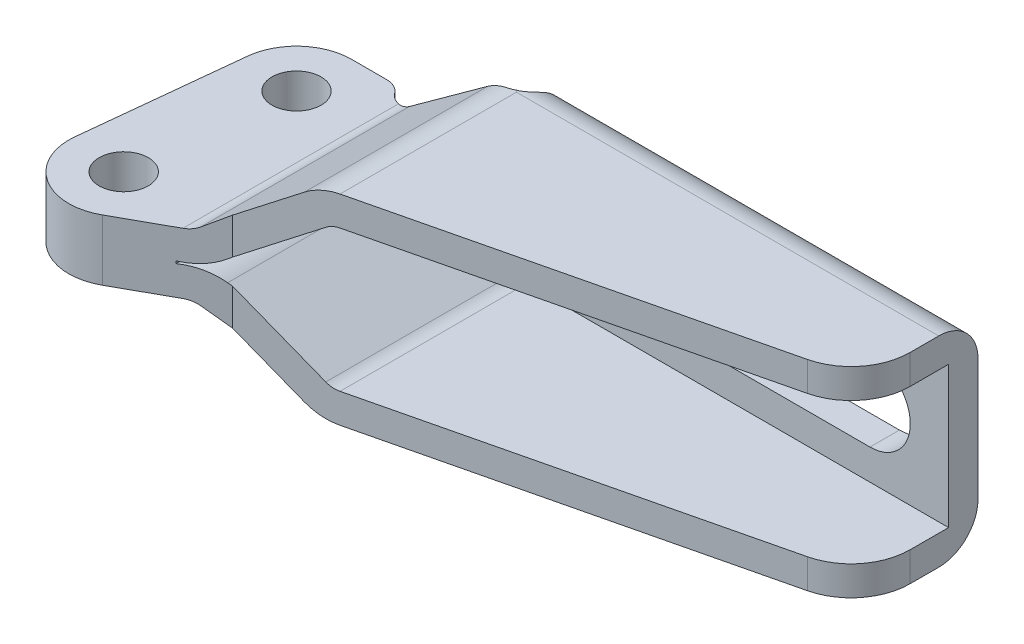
ISO-10303-21;
HEADER;
FILE_DESCRIPTION(('STEP AP214'),'2;1');
FILE_NAME('part.step','',(''),(''),'','','');
FILE_SCHEMA(('AUTOMOTIVE_DESIGN { 1 0 10303 214 1 1 1 1 }'));
ENDSEC;
DATA;
#1=APPLICATION_CONTEXT('core data for automotive mechanical design processes');
#2=APPLICATION_PROTOCOL_DEFINITION('international standard','automotive_design',2000,#1);
#3=PRODUCT_CONTEXT('',#1,'mechanical');
#4=PRODUCT('Part','Part','',(#3));
#5=PRODUCT_RELATED_PRODUCT_CATEGORY('part','',(#4));
#6=PRODUCT_DEFINITION_FORMATION('','',#4);
#7=PRODUCT_DEFINITION_CONTEXT('part definition',#1,'design');
#8=PRODUCT_DEFINITION('design','',#6,#7);
#9=PRODUCT_DEFINITION_SHAPE('','',#8);
#10=(LENGTH_UNIT() NAMED_UNIT(*) SI_UNIT(.MILLI.,.METRE.));
#11=(NAMED_UNIT(*) PLANE_ANGLE_UNIT() SI_UNIT($,.RADIAN.));
#12=(NAMED_UNIT(*) SI_UNIT($,.STERADIAN.) SOLID_ANGLE_UNIT());
#13=UNCERTAINTY_MEASURE_WITH_UNIT(LENGTH_MEASURE(1.E-05),#10,'distance_accuracy_value','');
#14=(GEOMETRIC_REPRESENTATION_CONTEXT(3) GLOBAL_UNCERTAINTY_ASSIGNED_CONTEXT((#13)) GLOBAL_UNIT_ASSIGNED_CONTEXT((#10,
#11,#12)) REPRESENTATION_CONTEXT('',''));
#15=CARTESIAN_POINT('',(0.,0.,0.));
#16=DIRECTION('',(0.,0.,1.));
#17=DIRECTION('',(1.,0.,0.));
#18=AXIS2_PLACEMENT_3D('',#15,#16,#17);
#19=CARTESIAN_POINT('',(-5.64,1.55,12.76));
#20=DIRECTION('',(0.,1.,0.));
#21=DIRECTION('',(0.,0.,-1.));
#22=AXIS2_PLACEMENT_3D('',#19,#20,#21);
#23=PLANE('',#22);
#24=CARTESIAN_POINT('',(0.,1.55,0.));
#25=DIRECTION('',(0.,1.,0.));
#26=DIRECTION('',(-1.,0.,0.));
#27=AXIS2_PLACEMENT_3D('',#24,#25,#26);
#28=CIRCLE('',#27,1.25);
#29=CARTESIAN_POINT('',(-1.25,1.55,0.));
#30=VERTEX_POINT('',#29);
#31=EDGE_CURVE('E914',#30,#30,#28,.T.);
#32=ORIENTED_EDGE('',*,*,#31,.F.);
#33=EDGE_LOOP('',(#32));
#34=FACE_BOUND('',#33,.T.);
#35=CARTESIAN_POINT('',(1.80000000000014,1.55,-1.80000000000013));
#36=DIRECTION('',(0.,1.,0.));
#37=DIRECTION('',(0.,0.,-1.));
#38=AXIS2_PLACEMENT_3D('',#35,#36,#37);
#39=CIRCLE('',#38,0.999999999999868);
#40=CARTESIAN_POINT('',(1.8,1.55,-2.8));
#41=VERTEX_POINT('',#40);
#42=CARTESIAN_POINT('',(2.6000000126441,1.55,-2.3999999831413));
#43=VERTEX_POINT('',#42);
#44=EDGE_CURVE('E818',#41,#43,#39,.F.);
#45=ORIENTED_EDGE('',*,*,#44,.F.);
#46=DIRECTION('',(1.,0.,0.));
#47=VECTOR('',#46,1.);
#48=CARTESIAN_POINT('',(1.8,1.55,-2.8));
#49=LINE('',#48,#47);
#50=CARTESIAN_POINT('',(0.,1.55,-2.8));
#51=VERTEX_POINT('',#50);
#52=EDGE_CURVE('E824',#51,#41,#49,.T.);
#53=ORIENTED_EDGE('',*,*,#52,.F.);
#54=CARTESIAN_POINT('',(0.,1.55,-1.07336015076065E-13));
#55=DIRECTION('',(0.,1.,0.));
#56=DIRECTION('',(0.,0.,-1.));
#57=AXIS2_PLACEMENT_3D('',#54,#55,#56);
#58=CIRCLE('',#57,2.7999999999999);
#59=CARTESIAN_POINT('',(-2.7845385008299,1.55,-0.29384577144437));
#60=VERTEX_POINT('',#59);
#61=EDGE_CURVE('E827',#60,#51,#58,.F.);
#62=ORIENTED_EDGE('',*,*,#61,.F.);
#63=DIRECTION('',(0.104944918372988,0.,-0.994478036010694));
#64=VECTOR('',#63,1.);
#65=CARTESIAN_POINT('',(-2.7845385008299,1.55,-0.293845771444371));
#66=LINE('',#65,#64);
#67=CARTESIAN_POINT('',(-3.6245385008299,1.55,7.6661542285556));
#68=VERTEX_POINT('',#67);
#69=EDGE_CURVE('E831',#68,#60,#66,.T.);
#70=ORIENTED_EDGE('',*,*,#69,.F.);
#71=CARTESIAN_POINT('',(-0.839999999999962,1.55,7.95999999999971));
#72=DIRECTION('',(0.,1.,0.));
#73=DIRECTION('',(0.,0.,-1.));
#74=AXIS2_PLACEMENT_3D('',#71,#72,#73);
#75=CIRCLE('',#74,2.8);
#76=CARTESIAN_POINT('',(0.51746693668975,1.55,10.40893517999));
#77=VERTEX_POINT('',#76);
#78=EDGE_CURVE('E902',#77,#68,#75,.F.);
#79=ORIENTED_EDGE('',*,*,#78,.F.);
#80=DIRECTION('',(-0.874619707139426,0.,0.484809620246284));
#81=VECTOR('',#80,1.);
#82=CARTESIAN_POINT('',(0.51746693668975,1.55,10.40893517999));
#83=LINE('',#82,#81);
#84=CARTESIAN_POINT('',(3.16,1.55,8.94415518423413));
#85=VERTEX_POINT('',#84);
#86=EDGE_CURVE('E532',#85,#77,#83,.T.);
#87=ORIENTED_EDGE('',*,*,#86,.F.);
#88=DIRECTION('',(0.,0.,-1.));
#89=VECTOR('',#88,1.);
#90=CARTESIAN_POINT('',(3.16,1.55,12.76));
#91=LINE('',#90,#89);
#92=CARTESIAN_POINT('',(3.16,1.55,-2.02922711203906));
#93=VERTEX_POINT('',#92);
#94=EDGE_CURVE('E886',#85,#93,#91,.T.);
#95=ORIENTED_EDGE('',*,*,#94,.T.);
#96=CARTESIAN_POINT('',(3.39999999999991,1.55,-2.99999999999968));
#97=DIRECTION('',(0.,1.,0.));
#98=DIRECTION('',(0.,0.,-1.));
#99=AXIS2_PLACEMENT_3D('',#96,#97,#98);
#100=CIRCLE('',#99,0.999999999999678);
#101=EDGE_CURVE('E829',#43,#93,#100,.T.);
#102=ORIENTED_EDGE('',*,*,#101,.F.);
#103=EDGE_LOOP('',(#45,#53,#62,#70,#79,#87,#95,#102));
#104=FACE_BOUND('',#103,.T.);
#105=CARTESIAN_POINT('',(-0.84,1.55,7.96));
#106=DIRECTION('',(0.,1.,0.));
#107=DIRECTION('',(-1.,0.,0.));
#108=AXIS2_PLACEMENT_3D('',#105,#106,#107);
#109=CIRCLE('',#108,1.25);
#110=CARTESIAN_POINT('',(-2.09,1.55,7.96));
#111=VERTEX_POINT('',#110);
#112=EDGE_CURVE('E909',#111,#111,#109,.T.);
#113=ORIENTED_EDGE('',*,*,#112,.F.);
#114=EDGE_LOOP('',(#113));
#115=FACE_BOUND('',#114,.T.);
#116=ADVANCED_FACE('F14',(#34,#104,#115),#23,.T.);
#117=CARTESIAN_POINT('',(8.7,5.1,-3.));
#118=DIRECTION('',(0.,-1.,0.));
#119=DIRECTION('',(1.,0.,0.));
#120=AXIS2_PLACEMENT_3D('',#117,#118,#119);
#121=PLANE('',#120);
#122=DIRECTION('',(-1.,0.,0.));
#123=VECTOR('',#122,1.);
#124=CARTESIAN_POINT('',(30.7,5.1,-2.));
#125=LINE('',#124,#123);
#126=CARTESIAN_POINT('',(30.7,5.1,-2.));
#127=VERTEX_POINT('',#126);
#128=CARTESIAN_POINT('',(9.19999999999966,5.1,-2.));
#129=VERTEX_POINT('',#128);
#130=EDGE_CURVE('E324',#127,#129,#125,.T.);
#131=ORIENTED_EDGE('',*,*,#130,.T.);
#132=DIRECTION('',(0.,0.,-1.));
#133=VECTOR('',#132,1.);
#134=CARTESIAN_POINT('',(9.2,5.1,12.76));
#135=LINE('',#134,#133);
#136=CARTESIAN_POINT('',(9.19999999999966,5.1,6.98315857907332));
#137=VERTEX_POINT('',#136);
#138=EDGE_CURVE('E875',#137,#129,#135,.T.);
#139=ORIENTED_EDGE('',*,*,#138,.F.);
#140=DIRECTION('',(0.972410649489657,0.,-0.233275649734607));
#141=VECTOR('',#140,1.);
#142=CARTESIAN_POINT('',(4.7885355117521,5.1,8.0414432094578));
#143=LINE('',#142,#141);
#144=CARTESIAN_POINT('',(28.399826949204,5.1,2.377231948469));
#145=VERTEX_POINT('',#144);
#146=EDGE_CURVE('E454',#137,#145,#143,.T.);
#147=ORIENTED_EDGE('',*,*,#146,.T.);
#148=CARTESIAN_POINT('',(27.7000000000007,5.1,-0.539999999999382));
#149=DIRECTION('',(0.,1.,0.));
#150=DIRECTION('',(-1.,0.,0.));
#151=AXIS2_PLACEMENT_3D('',#148,#149,#150);
#152=CIRCLE('',#151,2.99999999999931);
#153=CARTESIAN_POINT('',(30.7,5.1,-0.54));
#154=VERTEX_POINT('',#153);
#155=EDGE_CURVE('E457',#145,#154,#152,.T.);
#156=ORIENTED_EDGE('',*,*,#155,.T.);
#157=DIRECTION('',(0.,0.,-1.));
#158=VECTOR('',#157,1.);
#159=CARTESIAN_POINT('',(30.7,5.1,-0.54));
#160=LINE('',#159,#158);
#161=EDGE_CURVE('E453',#154,#127,#160,.T.);
#162=ORIENTED_EDGE('',*,*,#161,.T.);
#163=EDGE_LOOP('',(#131,#139,#147,#156,#162));
#164=FACE_BOUND('',#163,.T.);
#165=ADVANCED_FACE('F428',(#164),#121,.F.);
#166=CARTESIAN_POINT('',(8.7,-5.1,-3.));
#167=DIRECTION('',(0.,-1.,0.));
#168=DIRECTION('',(1.,0.,0.));
#169=AXIS2_PLACEMENT_3D('',#166,#167,#168);
#170=PLANE('',#169);
#171=DIRECTION('',(0.,0.,-1.));
#172=VECTOR('',#171,1.);
#173=CARTESIAN_POINT('',(9.2,-5.1,12.76));
#174=LINE('',#173,#172);
#175=CARTESIAN_POINT('',(9.2,-5.1,6.98315857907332));
#176=VERTEX_POINT('',#175);
#177=CARTESIAN_POINT('',(9.2,-5.1,-2.));
#178=VERTEX_POINT('',#177);
#179=EDGE_CURVE('E759',#176,#178,#174,.T.);
#180=ORIENTED_EDGE('',*,*,#179,.T.);
#181=DIRECTION('',(-1.,0.,0.));
#182=VECTOR('',#181,1.);
#183=CARTESIAN_POINT('',(30.7,-5.1,-2.));
#184=LINE('',#183,#182);
#185=CARTESIAN_POINT('',(30.7,-5.1,-2.));
#186=VERTEX_POINT('',#185);
#187=EDGE_CURVE('E332',#186,#178,#184,.T.);
#188=ORIENTED_EDGE('',*,*,#187,.F.);
#189=DIRECTION('',(0.,0.,-1.));
#190=VECTOR('',#189,1.);
#191=CARTESIAN_POINT('',(30.7,-5.1,-0.54));
#192=LINE('',#191,#190);
#193=CARTESIAN_POINT('',(30.7,-5.1,-0.54));
#194=VERTEX_POINT('',#193);
#195=EDGE_CURVE('E460',#194,#186,#192,.T.);
#196=ORIENTED_EDGE('',*,*,#195,.F.);
#197=CARTESIAN_POINT('',(27.7000000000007,-5.1,-0.539999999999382));
#198=DIRECTION('',(0.,1.,0.));
#199=DIRECTION('',(-1.,0.,0.));
#200=AXIS2_PLACEMENT_3D('',#197,#198,#199);
#201=CIRCLE('',#200,2.99999999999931);
#202=CARTESIAN_POINT('',(28.399826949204,-5.1,2.377231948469));
#203=VERTEX_POINT('',#202);
#204=EDGE_CURVE('E465',#203,#194,#201,.T.);
#205=ORIENTED_EDGE('',*,*,#204,.F.);
#206=DIRECTION('',(0.972410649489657,0.,-0.233275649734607));
#207=VECTOR('',#206,1.);
#208=CARTESIAN_POINT('',(4.7885355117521,-5.1,8.0414432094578));
#209=LINE('',#208,#207);
#210=EDGE_CURVE('E463',#176,#203,#209,.T.);
#211=ORIENTED_EDGE('',*,*,#210,.F.);
#212=EDGE_LOOP('',(#180,#188,#196,#205,#211));
#213=FACE_BOUND('',#212,.T.);
#214=ADVANCED_FACE('F775',(#213),#170,.T.);
#215=CARTESIAN_POINT('',(30.7,-5.1,-4.));
#216=DIRECTION('',(0.,0.,-1.));
#217=DIRECTION('',(0.,-1.,0.));
#218=AXIS2_PLACEMENT_3D('',#215,#216,#217);
#219=PLANE('',#218);
#220=DIRECTION('',(-1.,0.,0.));
#221=VECTOR('',#220,1.);
#222=CARTESIAN_POINT('',(30.7,-2.05,-4.));
#223=LINE('',#222,#221);
#224=CARTESIAN_POINT('',(26.7,-2.05,-4.));
#225=VERTEX_POINT('',#224);
#226=CARTESIAN_POINT('',(13.7,-2.05,-4.));
#227=VERTEX_POINT('',#226);
#228=EDGE_CURVE('E313',#225,#227,#223,.T.);
#229=ORIENTED_EDGE('',*,*,#228,.F.);
#230=CARTESIAN_POINT('',(26.7,0.,-4.));
#231=DIRECTION('',(0.,0.,-1.));
#232=DIRECTION('',(0.,-1.,0.));
#233=AXIS2_PLACEMENT_3D('',#230,#231,#232);
#234=CIRCLE('',#233,2.05);
#235=CARTESIAN_POINT('',(26.7,2.05,-4.));
#236=VERTEX_POINT('',#235);
#237=EDGE_CURVE('E311',#236,#225,#234,.T.);
#238=ORIENTED_EDGE('',*,*,#237,.F.);
#239=DIRECTION('',(1.,0.,0.));
#240=VECTOR('',#239,1.);
#241=CARTESIAN_POINT('',(30.7,2.05,-4.));
#242=LINE('',#241,#240);
#243=CARTESIAN_POINT('',(13.7,2.05,-4.));
#244=VERTEX_POINT('',#243);
#245=EDGE_CURVE('E296',#244,#236,#242,.T.);
#246=ORIENTED_EDGE('',*,*,#245,.F.);
#247=CARTESIAN_POINT('',(13.7,0.,-4.));
#248=DIRECTION('',(0.,0.,-1.));
#249=DIRECTION('',(0.,-1.,0.));
#250=AXIS2_PLACEMENT_3D('',#247,#248,#249);
#251=CIRCLE('',#250,2.05);
#252=EDGE_CURVE('E291',#227,#244,#251,.T.);
#253=ORIENTED_EDGE('',*,*,#252,.F.);
#254=EDGE_LOOP('',(#229,#238,#246,#253));
#255=FACE_BOUND('',#254,.T.);
#256=DIRECTION('',(-1.,0.,0.));
#257=VECTOR('',#256,1.);
#258=CARTESIAN_POINT('',(30.7,-3.1,-4.));
#259=LINE('',#258,#257);
#260=CARTESIAN_POINT('',(30.7,-3.1,-4.));
#261=VERTEX_POINT('',#260);
#262=CARTESIAN_POINT('',(9.7,-3.1,-4.));
#263=VERTEX_POINT('',#262);
#264=EDGE_CURVE('E329',#261,#263,#259,.T.);
#265=ORIENTED_EDGE('',*,*,#264,.T.);
#266=DIRECTION('',(0.,1.,0.));
#267=VECTOR('',#266,1.);
#268=CARTESIAN_POINT('',(9.7,-5.1,-4.));
#269=LINE('',#268,#267);
#270=CARTESIAN_POINT('',(9.7,3.1,-4.));
#271=VERTEX_POINT('',#270);
#272=EDGE_CURVE('E511',#263,#271,#269,.T.);
#273=ORIENTED_EDGE('',*,*,#272,.T.);
#274=DIRECTION('',(-1.,0.,0.));
#275=VECTOR('',#274,1.);
#276=CARTESIAN_POINT('',(30.7,3.1,-4.));
#277=LINE('',#276,#275);
#278=CARTESIAN_POINT('',(30.7,3.1,-4.));
#279=VERTEX_POINT('',#278);
#280=EDGE_CURVE('E327',#279,#271,#277,.T.);
#281=ORIENTED_EDGE('',*,*,#280,.F.);
#282=DIRECTION('',(0.,1.,0.));
#283=VECTOR('',#282,1.);
#284=CARTESIAN_POINT('',(30.7,-5.1,-4.));
#285=LINE('',#284,#283);
#286=EDGE_CURVE('E514',#261,#279,#285,.T.);
#287=ORIENTED_EDGE('',*,*,#286,.F.);
#288=EDGE_LOOP('',(#265,#273,#281,#287));
#289=FACE_BOUND('',#288,.T.);
#290=ADVANCED_FACE('F309',(#255,#289),#219,.T.);
#291=CARTESIAN_POINT('',(8.7,-5.1,-3.));
#292=DIRECTION('',(0.,1.,0.));
#293=DIRECTION('',(-1.,0.,0.));
#294=AXIS2_PLACEMENT_3D('',#291,#292,#293);
#295=CYLINDRICAL_SURFACE('',#294,1.);
#296=CARTESIAN_POINT('',(8.7,-5.1,-2.));
#297=CARTESIAN_POINT('',(8.72806493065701,-5.09999661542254,-2.00000019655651));
#298=CARTESIAN_POINT('',(8.75611643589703,-5.1000003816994,-2.00118220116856));
#299=CARTESIAN_POINT('',(8.81201998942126,-5.0999933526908,-2.0058977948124));
#300=CARTESIAN_POINT('',(8.83987204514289,-5.09998255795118,-2.00943129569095));
#301=CARTESIAN_POINT('',(8.92280713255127,-5.09988512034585,-2.02352987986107));
#302=CARTESIAN_POINT('',(8.97733703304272,-5.09973355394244,-2.0375931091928));
#303=CARTESIAN_POINT('',(9.08327174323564,-5.0986910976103,-2.07465795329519));
#304=CARTESIAN_POINT('',(9.13467460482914,-5.09779975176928,-2.09766507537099));
#305=CARTESIAN_POINT('',(9.23286465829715,-5.09440455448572,-2.15194417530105));
#306=CARTESIAN_POINT('',(9.27965258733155,-5.09190096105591,-2.18321483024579));
#307=CARTESIAN_POINT('',(9.36676018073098,-5.08427866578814,-2.25267023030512));
#308=CARTESIAN_POINT('',(9.40714126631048,-5.0791870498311,-2.29078076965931));
#309=CARTESIAN_POINT('',(9.48077216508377,-5.06539263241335,-2.37276360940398));
#310=CARTESIAN_POINT('',(9.51402759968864,-5.05669269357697,-2.41663132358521));
#311=CARTESIAN_POINT('',(9.57132854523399,-5.03532162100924,-2.50653093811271));
#312=CARTESIAN_POINT('',(9.59569573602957,-5.02282791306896,-2.55240038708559));
#313=CARTESIAN_POINT('',(9.63671189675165,-4.99337678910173,-2.64617446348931));
#314=CARTESIAN_POINT('',(9.65335300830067,-4.97641485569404,-2.69408110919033));
#315=CARTESIAN_POINT('',(9.67779780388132,-4.93982171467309,-2.78565205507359));
#316=CARTESIAN_POINT('',(9.68627748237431,-4.92058347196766,-2.82929813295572));
#317=CARTESIAN_POINT('',(9.69738852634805,-4.87876044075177,-2.91561539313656));
#318=CARTESIAN_POINT('',(9.7000324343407,-4.85618294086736,-2.95828847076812));
#319=CARTESIAN_POINT('',(9.7,-4.83205080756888,-3.));
#320=B_SPLINE_CURVE_WITH_KNOTS('',3,(#296,#297,#298,#299,#300,#301,#302,#303,#304,#305,#306,
#307,#308,#309,#310,#311,#312,#313,#314,#315,#316,#317,#318,#319),.UNSPECIFIED.,.F.,.F.,(4,2,2,
2,2,2,2,2,2,2,2,4),(0.,0.0841432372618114,0.168283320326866,0.336362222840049,0.504544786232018,
0.672700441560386,0.83913136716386,1.00543050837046,1.16491201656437,1.32455538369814,
1.46940628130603,1.61394555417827),.UNSPECIFIED.);
#321=CARTESIAN_POINT('',(9.10446401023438,-5.09817390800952,-2.08544608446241));
#322=VERTEX_POINT('',#321);
#323=CARTESIAN_POINT('',(9.7,-4.83205080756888,-3.));
#324=VERTEX_POINT('',#323);
#325=EDGE_CURVE('E934',#322,#324,#320,.T.);
#326=ORIENTED_EDGE('',*,*,#325,.F.);
#327=CARTESIAN_POINT('',(9.2,-5.1,-2.13397459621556));
#328=CARTESIAN_POINT('',(9.17672763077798,-5.10000080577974,-2.12053853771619));
#329=CARTESIAN_POINT('',(9.15292530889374,-5.09967444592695,-2.10804799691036));
#330=CARTESIAN_POINT('',(9.10440440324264,-5.09828965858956,-2.08502484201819));
#331=CARTESIAN_POINT('',(9.07968555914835,-5.09723102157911,-2.07449278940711));
#332=CARTESIAN_POINT('',(9.00560202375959,-5.09291092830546,-2.04640491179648));
#333=CARTESIAN_POINT('',(8.95517106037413,-5.08851188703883,-2.03170408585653));
#334=CARTESIAN_POINT('',(8.87064055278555,-5.07844025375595,-2.01406984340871));
#335=CARTESIAN_POINT('',(8.83687839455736,-5.07372342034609,-2.00882920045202));
#336=CARTESIAN_POINT('',(8.76870084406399,-5.06276280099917,-2.00176448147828));
#337=CARTESIAN_POINT('',(8.73428343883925,-5.05649647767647,-1.99999462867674));
#338=CARTESIAN_POINT('',(8.7,-5.04948974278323,-2.));
#339=B_SPLINE_CURVE_WITH_KNOTS('',3,(#327,#328,#329,#330,#331,#332,#333,#334,#335,#336,#337,
#338),.UNSPECIFIED.,.F.,.F.,(4,2,2,2,2,4),(0.,0.0805651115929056,0.161153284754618,
0.318439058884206,0.421724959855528,0.526612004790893),.UNSPECIFIED.);
#340=CARTESIAN_POINT('',(8.7,-5.04948974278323,-2.));
#341=VERTEX_POINT('',#340);
#342=EDGE_CURVE('E753',#322,#341,#339,.T.);
#343=ORIENTED_EDGE('',*,*,#342,.T.);
#344=DIRECTION('',(0.,1.,0.));
#345=VECTOR('',#344,1.);
#346=CARTESIAN_POINT('',(8.7,-5.1,-2.));
#347=LINE('',#346,#345);
#348=CARTESIAN_POINT('',(8.7,-3.46602540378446,-2.));
#349=VERTEX_POINT('',#348);
#350=EDGE_CURVE('E505',#341,#349,#347,.T.);
#351=ORIENTED_EDGE('',*,*,#350,.T.);
#352=CARTESIAN_POINT('',(8.7,-3.46602540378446,-2.));
#353=CARTESIAN_POINT('',(8.71836259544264,-3.47662838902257,-1.99999946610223));
#354=CARTESIAN_POINT('',(8.73705877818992,-3.48664160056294,-2.00050659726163));
#355=CARTESIAN_POINT('',(8.7750037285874,-3.50544294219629,-2.00263537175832));
#356=CARTESIAN_POINT('',(8.79425270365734,-3.51423060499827,-2.00425743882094));
#357=CARTESIAN_POINT('',(8.85258559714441,-3.53865461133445,-2.01093870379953));
#358=CARTESIAN_POINT('',(8.89230311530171,-3.55237936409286,-2.01781246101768));
#359=CARTESIAN_POINT('',(8.9720416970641,-3.57455435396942,-2.03683823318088));
#360=CARTESIAN_POINT('',(9.01206328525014,-3.5829905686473,-2.04900413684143));
#361=CARTESIAN_POINT('',(9.09079929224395,-3.59481361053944,-2.07856850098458));
#362=CARTESIAN_POINT('',(9.12951661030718,-3.59821247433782,-2.09595436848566));
#363=CARTESIAN_POINT('',(9.17810331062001,-3.59982351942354,-2.1216043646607));
#364=CARTESIAN_POINT('',(9.18911538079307,-3.60000223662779,-2.12768704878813));
#365=CARTESIAN_POINT('',(9.2,-3.6,-2.13397459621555));
#366=B_SPLINE_CURVE_WITH_KNOTS('',3,(#352,#353,#354,#355,#356,#357,#358,#359,#360,#361,#362,
#363,#364,#365),.UNSPECIFIED.,.F.,.F.,(4,2,2,2,2,2,4),(0.,0.0635804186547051,0.127185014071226,
0.254231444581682,0.381613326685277,0.508690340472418,0.546417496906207),.UNSPECIFIED.);
#367=CARTESIAN_POINT('',(9.2,-3.6,-2.13397459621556));
#368=VERTEX_POINT('',#367);
#369=EDGE_CURVE('E631',#349,#368,#366,.T.);
#370=ORIENTED_EDGE('',*,*,#369,.T.);
#371=CARTESIAN_POINT('',(8.7,-3.6,-3.));
#372=DIRECTION('',(0.,1.,0.));
#373=DIRECTION('',(0.,0.,-1.));
#374=AXIS2_PLACEMENT_3D('',#371,#372,#373);
#375=CIRCLE('',#374,1.);
#376=CARTESIAN_POINT('',(9.7,-3.6,-3.));
#377=VERTEX_POINT('',#376);
#378=EDGE_CURVE('E617',#368,#377,#375,.T.);
#379=ORIENTED_EDGE('',*,*,#378,.T.);
#380=DIRECTION('',(0.,1.,0.));
#381=VECTOR('',#380,1.);
#382=CARTESIAN_POINT('',(9.7,-5.1,-3.));
#383=LINE('',#382,#381);
#384=EDGE_CURVE('E509',#324,#377,#383,.T.);
#385=ORIENTED_EDGE('',*,*,#384,.F.);
#386=EDGE_LOOP('',(#326,#343,#351,#370,#379,#385));
#387=FACE_BOUND('',#386,.T.);
#388=ADVANCED_FACE('F742',(#387),#295,.F.);
#389=CARTESIAN_POINT('',(9.7,4.83205080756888,-3.));
#390=CARTESIAN_POINT('',(9.69999952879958,4.84596359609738,-2.97590589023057));
#391=CARTESIAN_POINT('',(9.69912814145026,4.85936677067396,-2.95152461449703));
#392=CARTESIAN_POINT('',(9.69552438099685,4.88510203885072,-2.90232027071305));
#393=CARTESIAN_POINT('',(9.69279086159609,4.897433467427,-2.87749693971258));
#394=CARTESIAN_POINT('',(9.68161715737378,4.93272531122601,-2.80259138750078));
#395=CARTESIAN_POINT('',(9.67020366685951,4.95397385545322,-2.752089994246));
#396=CARTESIAN_POINT('',(9.63885617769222,4.99161430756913,-2.65167971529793));
#397=CARTESIAN_POINT('',(9.61888863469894,5.00798666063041,-2.60177396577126));
#398=CARTESIAN_POINT('',(9.57050046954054,5.03588393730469,-2.50486907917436));
#399=CARTESIAN_POINT('',(9.54209287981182,5.04741626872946,-2.45786559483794));
#400=CARTESIAN_POINT('',(9.47937052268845,5.06570273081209,-2.37129428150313));
#401=CARTESIAN_POINT('',(9.44550358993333,5.0726987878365,-2.33145128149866));
#402=CARTESIAN_POINT('',(9.37170111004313,5.08373060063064,-2.25733263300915));
#403=CARTESIAN_POINT('',(9.33176173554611,5.08776447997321,-2.22306052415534));
#404=CARTESIAN_POINT('',(9.24620278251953,5.09378906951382,-2.16064731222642));
#405=CARTESIAN_POINT('',(9.20050060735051,5.09574509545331,-2.13261628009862));
#406=CARTESIAN_POINT('',(9.10518681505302,5.09837420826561,-2.08420389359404));
#407=CARTESIAN_POINT('',(9.05557514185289,5.09904727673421,-2.0638226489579));
#408=CARTESIAN_POINT('',(8.95549913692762,5.09980923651,-2.03181606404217));
#409=CARTESIAN_POINT('',(8.90512561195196,5.09991777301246,-2.01990891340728));
#410=CARTESIAN_POINT('',(8.82868019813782,5.09998752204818,-2.00797716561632));
#411=CARTESIAN_POINT('',(8.8030396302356,5.09999524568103,-2.00498807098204));
#412=CARTESIAN_POINT('',(8.75160278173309,5.10000027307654,-2.00099946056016));
#413=CARTESIAN_POINT('',(8.725806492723,5.09999757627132,-2.00000005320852));
#414=CARTESIAN_POINT('',(8.7,5.1,-2.));
#415=B_SPLINE_CURVE_WITH_KNOTS('',3,(#389,#390,#391,#392,#393,#394,#395,#396,#397,#398,#399,
#400,#401,#402,#403,#404,#405,#406,#407,#408,#409,#410,#411,#412,#413,#414),.UNSPECIFIED.,.F.,
.F.,(4,2,2,2,2,2,2,2,2,2,2,2,4),(0.,0.0834312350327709,0.166913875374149,0.333935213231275,
0.501617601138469,0.669042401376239,0.826581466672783,0.984220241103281,1.14445090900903,
1.30468387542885,1.45930167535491,1.53667730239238,1.61405714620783),.UNSPECIFIED.);
#416=CARTESIAN_POINT('',(9.7,4.83205080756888,-3.));
#417=VERTEX_POINT('',#416);
#418=CARTESIAN_POINT('',(9.10446401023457,5.09817390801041,-2.08544608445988));
#419=VERTEX_POINT('',#418);
#420=EDGE_CURVE('E334',#417,#419,#415,.T.);
#421=ORIENTED_EDGE('',*,*,#420,.F.);
#422=CARTESIAN_POINT('',(9.7,3.6,-3.));
#423=VERTEX_POINT('',#422);
#424=EDGE_CURVE('E508',#423,#417,#383,.T.);
#425=ORIENTED_EDGE('',*,*,#424,.F.);
#426=CARTESIAN_POINT('',(8.7,3.6,-3.));
#427=DIRECTION('',(0.,-1.,0.));
#428=DIRECTION('',(0.,0.,1.));
#429=AXIS2_PLACEMENT_3D('',#426,#427,#428);
#430=CIRCLE('',#429,1.);
#431=CARTESIAN_POINT('',(9.2,3.6,-2.13397459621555));
#432=VERTEX_POINT('',#431);
#433=EDGE_CURVE('E625',#423,#432,#430,.T.);
#434=ORIENTED_EDGE('',*,*,#433,.T.);
#435=CARTESIAN_POINT('',(9.2,3.6,-2.13397459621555));
#436=CARTESIAN_POINT('',(9.18163740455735,3.60000053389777,-2.12337161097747));
#437=CARTESIAN_POINT('',(9.16294122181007,3.59949340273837,-2.11335839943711));
#438=CARTESIAN_POINT('',(9.12499627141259,3.59736462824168,-2.09455705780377));
#439=CARTESIAN_POINT('',(9.10574729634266,3.59574256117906,-2.08576939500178));
#440=CARTESIAN_POINT('',(9.0474144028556,3.58906129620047,-2.06134538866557));
#441=CARTESIAN_POINT('',(9.00769688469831,3.5821875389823,-2.04762063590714));
#442=CARTESIAN_POINT('',(8.92795830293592,3.56316176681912,-2.02544564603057));
#443=CARTESIAN_POINT('',(8.88793671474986,3.5509958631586,-2.01700943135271));
#444=CARTESIAN_POINT('',(8.80920070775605,3.52143149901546,-2.00518638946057));
#445=CARTESIAN_POINT('',(8.77048338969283,3.50404563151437,-2.00178752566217));
#446=CARTESIAN_POINT('',(8.72189668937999,3.47839563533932,-2.00017648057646));
#447=CARTESIAN_POINT('',(8.71088461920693,3.47231295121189,-1.9999977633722));
#448=CARTESIAN_POINT('',(8.7,3.46602540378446,-2.));
#449=B_SPLINE_CURVE_WITH_KNOTS('',3,(#435,#436,#437,#438,#439,#440,#441,#442,#443,#444,#445,
#446,#447,#448),.UNSPECIFIED.,.F.,.F.,(4,2,2,2,2,2,4),(0.,0.0635804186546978,0.127185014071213,
0.254231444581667,0.381613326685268,0.508690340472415,0.546417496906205),.UNSPECIFIED.);
#450=CARTESIAN_POINT('',(8.7,3.46602540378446,-2.));
#451=VERTEX_POINT('',#450);
#452=EDGE_CURVE('E668',#432,#451,#449,.T.);
#453=ORIENTED_EDGE('',*,*,#452,.T.);
#454=CARTESIAN_POINT('',(8.7,5.04948974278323,-2.));
#455=VERTEX_POINT('',#454);
#456=EDGE_CURVE('E504',#451,#455,#347,.T.);
#457=ORIENTED_EDGE('',*,*,#456,.T.);
#458=CARTESIAN_POINT('',(8.7,5.04948974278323,-2.));
#459=CARTESIAN_POINT('',(8.7263287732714,5.05486600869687,-2.00000007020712));
#460=CARTESIAN_POINT('',(8.75273208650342,5.05981080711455,-2.00104092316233));
#461=CARTESIAN_POINT('',(8.80552774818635,5.06882729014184,-2.00523045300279));
#462=CARTESIAN_POINT('',(8.83192009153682,5.07289873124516,-2.0083797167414));
#463=CARTESIAN_POINT('',(8.90954939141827,5.08360854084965,-2.02082523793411));
#464=CARTESIAN_POINT('',(8.96052527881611,5.08900195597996,-2.03311920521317));
#465=CARTESIAN_POINT('',(9.04295686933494,5.09527927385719,-2.06001765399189));
#466=CARTESIAN_POINT('',(9.07510575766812,5.09707566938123,-2.0723797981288));
#467=CARTESIAN_POINT('',(9.13848721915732,5.099448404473,-2.10058249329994));
#468=CARTESIAN_POINT('',(9.16969786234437,5.10000539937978,-2.11647399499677));
#469=CARTESIAN_POINT('',(9.2,5.1,-2.13397459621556));
#470=B_SPLINE_CURVE_WITH_KNOTS('',3,(#458,#459,#460,#461,#462,#463,#464,#465,#466,#467,#468,
#469),.UNSPECIFIED.,.F.,.F.,(4,2,2,2,2,4),(0.,0.0805647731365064,0.161151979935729,
0.318438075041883,0.42172443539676,0.526611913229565),.UNSPECIFIED.);
#471=EDGE_CURVE('E391',#455,#419,#470,.T.);
#472=ORIENTED_EDGE('',*,*,#471,.T.);
#473=EDGE_LOOP('',(#421,#425,#434,#453,#457,#472));
#474=FACE_BOUND('',#473,.T.);
#475=ADVANCED_FACE('F344',(#474),#295,.F.);
#476=CARTESIAN_POINT('',(8.7,-5.1,-2.));
#477=DIRECTION('',(0.,0.,-1.));
#478=DIRECTION('',(0.,-1.,0.));
#479=AXIS2_PLACEMENT_3D('',#476,#477,#478);
#480=PLANE('',#479);
#481=ORIENTED_EDGE('',*,*,#456,.F.);
#482=CARTESIAN_POINT('',(9.2,2.59999999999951,-2.));
#483=DIRECTION('',(0.,0.,-1.));
#484=DIRECTION('',(0.,-1.,0.));
#485=AXIS2_PLACEMENT_3D('',#482,#483,#484);
#486=CIRCLE('',#485,1.00000000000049);
#487=CARTESIAN_POINT('',(8.6138229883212,3.4101830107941,-2.));
#488=VERTEX_POINT('',#487);
#489=EDGE_CURVE('E708',#451,#488,#486,.F.);
#490=ORIENTED_EDGE('',*,*,#489,.T.);
#491=DIRECTION('',(-0.810183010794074,-0.586177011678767,0.));
#492=VECTOR('',#491,1.);
#493=CARTESIAN_POINT('',(4.62881268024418,0.526980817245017,-2.));
#494=LINE('',#493,#492);
#495=CARTESIAN_POINT('',(4.6254425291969,0.524542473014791,-2.));
#496=VERTEX_POINT('',#495);
#497=EDGE_CURVE('E712',#488,#496,#494,.T.);
#498=ORIENTED_EDGE('',*,*,#497,.T.);
#499=CARTESIAN_POINT('',(3.16,2.55000000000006,-2.));
#500=DIRECTION('',(0.,0.,-1.));
#501=DIRECTION('',(0.,-1.,0.));
#502=AXIS2_PLACEMENT_3D('',#499,#500,#501);
#503=CIRCLE('',#502,2.50000000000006);
#504=CARTESIAN_POINT('',(3.4,0.0615466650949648,-2.));
#505=VERTEX_POINT('',#504);
#506=EDGE_CURVE('E685',#496,#505,#503,.T.);
#507=ORIENTED_EDGE('',*,*,#506,.T.);
#508=DIRECTION('',(0.,1.,0.));
#509=VECTOR('',#508,1.);
#510=CARTESIAN_POINT('',(3.4,-5.1,-2.));
#511=LINE('',#510,#509);
#512=CARTESIAN_POINT('',(3.4,1.57922711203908,-2.));
#513=VERTEX_POINT('',#512);
#514=EDGE_CURVE('E500',#505,#513,#511,.T.);
#515=ORIENTED_EDGE('',*,*,#514,.T.);
#516=CARTESIAN_POINT('',(3.15999999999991,2.55000000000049,-2.));
#517=DIRECTION('',(0.,0.,-1.));
#518=DIRECTION('',(0.,-1.,0.));
#519=AXIS2_PLACEMENT_3D('',#516,#517,#518);
#520=CIRCLE('',#519,1.00000000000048);
#521=CARTESIAN_POINT('',(3.7461770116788,1.7398169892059,-2.));
#522=VERTEX_POINT('',#521);
#523=EDGE_CURVE('E415',#513,#522,#520,.F.);
#524=ORIENTED_EDGE('',*,*,#523,.T.);
#525=DIRECTION('',(0.810183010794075,0.586177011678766,0.));
#526=VECTOR('',#525,1.);
#527=CARTESIAN_POINT('',(3.74954716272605,1.74225533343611,-2.));
#528=LINE('',#527,#526);
#529=CARTESIAN_POINT('',(7.7345574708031,4.6254575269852,-2.));
#530=VERTEX_POINT('',#529);
#531=EDGE_CURVE('E404',#522,#530,#528,.T.);
#532=ORIENTED_EDGE('',*,*,#531,.T.);
#533=CARTESIAN_POINT('',(9.19999999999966,2.60000000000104,-2.));
#534=DIRECTION('',(0.,0.,-1.));
#535=DIRECTION('',(0.,-1.,0.));
#536=AXIS2_PLACEMENT_3D('',#533,#534,#535);
#537=CIRCLE('',#536,2.49999999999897);
#538=EDGE_CURVE('E400',#530,#455,#537,.T.);
#539=ORIENTED_EDGE('',*,*,#538,.T.);
#540=EDGE_LOOP('',(#481,#490,#498,#507,#515,#524,#532,#539));
#541=FACE_BOUND('',#540,.T.);
#542=ADVANCED_FACE('F720',(#541),#480,.T.);
#543=CARTESIAN_POINT('',(3.4,-1.57922711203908,-2.));
#544=VERTEX_POINT('',#543);
#545=CARTESIAN_POINT('',(3.4,-0.0615466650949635,-2.));
#546=VERTEX_POINT('',#545);
#547=EDGE_CURVE('E501',#544,#546,#511,.T.);
#548=ORIENTED_EDGE('',*,*,#547,.T.);
#549=CARTESIAN_POINT('',(3.16,-2.55,-2.));
#550=DIRECTION('',(0.,0.,-1.));
#551=DIRECTION('',(0.,-1.,0.));
#552=AXIS2_PLACEMENT_3D('',#549,#550,#551);
#553=CIRCLE('',#552,2.5);
#554=CARTESIAN_POINT('',(4.6254425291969,-0.5245424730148,-2.));
#555=VERTEX_POINT('',#554);
#556=EDGE_CURVE('E667',#546,#555,#553,.T.);
#557=ORIENTED_EDGE('',*,*,#556,.T.);
#558=DIRECTION('',(0.810183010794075,-0.586177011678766,0.));
#559=VECTOR('',#558,1.);
#560=CARTESIAN_POINT('',(9.47290137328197,-4.03173640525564,-2.));
#561=LINE('',#560,#559);
#562=CARTESIAN_POINT('',(8.6138229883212,-3.4101830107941,-2.));
#563=VERTEX_POINT('',#562);
#564=EDGE_CURVE('E723',#555,#563,#561,.T.);
#565=ORIENTED_EDGE('',*,*,#564,.T.);
#566=CARTESIAN_POINT('',(9.2,-2.59999999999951,-2.));
#567=DIRECTION('',(0.,0.,-1.));
#568=DIRECTION('',(0.,-1.,0.));
#569=AXIS2_PLACEMENT_3D('',#566,#567,#568);
#570=CIRCLE('',#569,1.00000000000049);
#571=EDGE_CURVE('E628',#563,#349,#570,.F.);
#572=ORIENTED_EDGE('',*,*,#571,.T.);
#573=ORIENTED_EDGE('',*,*,#350,.F.);
#574=CARTESIAN_POINT('',(9.19999999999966,-2.60000000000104,-2.));
#575=DIRECTION('',(0.,0.,-1.));
#576=DIRECTION('',(0.,-1.,0.));
#577=AXIS2_PLACEMENT_3D('',#574,#575,#576);
#578=CIRCLE('',#577,2.49999999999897);
#579=CARTESIAN_POINT('',(7.7345574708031,-4.6254575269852,-2.));
#580=VERTEX_POINT('',#579);
#581=EDGE_CURVE('E748',#341,#580,#578,.T.);
#582=ORIENTED_EDGE('',*,*,#581,.T.);
#583=DIRECTION('',(-0.810183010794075,0.586177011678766,0.));
#584=VECTOR('',#583,1.);
#585=CARTESIAN_POINT('',(8.59363585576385,-5.24701092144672,-2.));
#586=LINE('',#585,#584);
#587=CARTESIAN_POINT('',(3.7461770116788,-1.7398169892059,-2.));
#588=VERTEX_POINT('',#587);
#589=EDGE_CURVE('E749',#580,#588,#586,.T.);
#590=ORIENTED_EDGE('',*,*,#589,.T.);
#591=CARTESIAN_POINT('',(3.15999999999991,-2.55000000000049,-2.));
#592=DIRECTION('',(0.,0.,-1.));
#593=DIRECTION('',(0.,-1.,0.));
#594=AXIS2_PLACEMENT_3D('',#591,#592,#593);
#595=CIRCLE('',#594,1.00000000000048);
#596=EDGE_CURVE('E448',#588,#544,#595,.F.);
#597=ORIENTED_EDGE('',*,*,#596,.T.);
#598=EDGE_LOOP('',(#548,#557,#565,#572,#573,#582,#590,#597));
#599=FACE_BOUND('',#598,.T.);
#600=ADVANCED_FACE('F744',(#599),#480,.T.);
#601=CARTESIAN_POINT('',(3.39999999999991,-5.1,-2.99999999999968));
#602=DIRECTION('',(0.,1.,0.));
#603=DIRECTION('',(-1.,0.,0.));
#604=AXIS2_PLACEMENT_3D('',#601,#602,#603);
#605=CYLINDRICAL_SURFACE('',#604,0.999999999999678);
#606=ORIENTED_EDGE('',*,*,#514,.F.);
#607=CARTESIAN_POINT('',(3.4,0.0615466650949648,-2.));
#608=CARTESIAN_POINT('',(3.3733586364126,0.0589753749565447,-2.00000013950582));
#609=CARTESIAN_POINT('',(3.34669144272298,0.0568377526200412,-2.00106575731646));
#610=CARTESIAN_POINT('',(3.29346745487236,0.0534229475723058,-2.00533176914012));
#611=CARTESIAN_POINT('',(3.26691068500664,0.0521459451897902,-2.00853261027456));
#612=CARTESIAN_POINT('',(3.18883487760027,0.0496344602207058,-2.02115407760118));
#613=CARTESIAN_POINT('',(3.13771664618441,0.04960710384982,-2.03359542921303));
#614=CARTESIAN_POINT('',(3.06204219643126,0.051783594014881,-2.05844010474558));
#615=CARTESIAN_POINT('',(3.03647428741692,0.052926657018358,-2.06801616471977));
#616=CARTESIAN_POINT('',(2.98595791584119,0.0559358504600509,-2.08932586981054));
#617=CARTESIAN_POINT('',(2.96101962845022,0.0578099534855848,-2.10108252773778));
#618=CARTESIAN_POINT('',(2.93661692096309,0.0599999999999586,-2.11384193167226));
#619=B_SPLINE_CURVE_WITH_KNOTS('',3,(#607,#608,#609,#610,#611,#612,#613,#614,#615,#616,#617,
#618),.UNSPECIFIED.,.F.,.F.,(4,2,2,2,2,4),(0.,0.0802386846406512,0.160494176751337,
0.31745384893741,0.399349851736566,0.482165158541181),.UNSPECIFIED.);
#620=CARTESIAN_POINT('',(2.9366169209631,0.0600000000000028,-2.1138419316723));
#621=VERTEX_POINT('',#620);
#622=EDGE_CURVE('E679',#505,#621,#619,.T.);
#623=ORIENTED_EDGE('',*,*,#622,.T.);
#624=DIRECTION('',(0.,1.,0.));
#625=VECTOR('',#624,1.);
#626=CARTESIAN_POINT('',(2.9366169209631,-5.1,-2.1138419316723));
#627=LINE('',#626,#625);
#628=CARTESIAN_POINT('',(2.9366169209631,-0.060000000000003,-2.1138419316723));
#629=VERTEX_POINT('',#628);
#630=EDGE_CURVE('E676',#621,#629,#627,.F.);
#631=ORIENTED_EDGE('',*,*,#630,.T.);
#632=CARTESIAN_POINT('',(2.9366169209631,-0.0600000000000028,-2.1138419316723));
#633=CARTESIAN_POINT('',(2.9602611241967,-0.0578782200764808,-2.10147929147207));
#634=CARTESIAN_POINT('',(2.98440786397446,-0.0560527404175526,-2.09005778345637));
#635=CARTESIAN_POINT('',(3.03358449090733,-0.0530764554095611,-2.06916410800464));
#636=CARTESIAN_POINT('',(3.05861481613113,-0.0519259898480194,-2.05969292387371));
#637=CARTESIAN_POINT('',(3.1336731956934,-0.0496477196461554,-2.03470188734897));
#638=CARTESIAN_POINT('',(3.18474166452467,-0.049591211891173,-2.02204569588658));
#639=CARTESIAN_POINT('',(3.26330372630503,-0.0519886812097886,-2.00900869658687));
#640=CARTESIAN_POINT('',(3.2903870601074,-0.0532545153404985,-2.00565192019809));
#641=CARTESIAN_POINT('',(3.34498845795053,-0.0567015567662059,-2.00113488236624));
#642=CARTESIAN_POINT('',(3.37250797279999,-0.0588929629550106,-1.99999991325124));
#643=CARTESIAN_POINT('',(3.4,-0.0615466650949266,-1.99999999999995));
#644=B_SPLINE_CURVE_WITH_KNOTS('',3,(#632,#633,#634,#635,#636,#637,#638,#639,#640,#641,#642,
#643),.UNSPECIFIED.,.F.,.F.,(4,2,2,2,2,4),(0.,0.0802432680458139,0.160526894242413,
0.317495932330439,0.399367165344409,0.482165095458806),.UNSPECIFIED.);
#645=EDGE_CURVE('E660',#629,#546,#644,.T.);
#646=ORIENTED_EDGE('',*,*,#645,.T.);
#647=ORIENTED_EDGE('',*,*,#547,.F.);
#648=CARTESIAN_POINT('',(3.4,-1.57922711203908,-2.));
#649=CARTESIAN_POINT('',(3.38013167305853,-1.5743111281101,-1.99999619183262));
#650=CARTESIAN_POINT('',(3.3601093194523,-1.57001239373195,-2.00059215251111));
#651=CARTESIAN_POINT('',(3.32005723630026,-1.56268485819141,-2.00300107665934));
#652=CARTESIAN_POINT('',(3.30002861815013,-1.55964705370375,-2.00480516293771));
#653=CARTESIAN_POINT('',(3.25997138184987,-1.55480516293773,-2.00964705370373));
#654=CARTESIAN_POINT('',(3.23994276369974,-1.55300107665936,-2.01268485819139));
#655=CARTESIAN_POINT('',(3.1998906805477,-1.55059215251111,-2.02001239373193));
#656=CARTESIAN_POINT('',(3.17986832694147,-1.54999619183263,-2.02431112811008));
#657=CARTESIAN_POINT('',(3.16,-1.55,-2.02922711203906));
#658=B_SPLINE_CURVE_WITH_KNOTS('',3,(#648,#649,#650,#651,#652,#653,#654,#655,#656,#657),
.UNSPECIFIED.,.F.,.F.,(4,2,2,2,4),(0.,0.0613857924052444,0.122325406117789,0.183265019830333,
0.244650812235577),.UNSPECIFIED.);
#659=CARTESIAN_POINT('',(3.16,-1.55,-2.02922711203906));
#660=VERTEX_POINT('',#659);
#661=EDGE_CURVE('E440',#544,#660,#658,.T.);
#662=ORIENTED_EDGE('',*,*,#661,.T.);
#663=CARTESIAN_POINT('',(3.39999999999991,-1.55,-2.99999999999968));
#664=DIRECTION('',(0.,-1.,0.));
#665=DIRECTION('',(0.,0.,1.));
#666=AXIS2_PLACEMENT_3D('',#663,#664,#665);
#667=CIRCLE('',#666,0.999999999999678);
#668=CARTESIAN_POINT('',(2.6000000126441,-1.55,-2.3999999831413));
#669=VERTEX_POINT('',#668);
#670=EDGE_CURVE('E449',#660,#669,#667,.T.);
#671=ORIENTED_EDGE('',*,*,#670,.T.);
#672=DIRECTION('',(0.,1.,0.));
#673=VECTOR('',#672,1.);
#674=CARTESIAN_POINT('',(2.6000000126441,-5.1,-2.3999999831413));
#675=LINE('',#674,#673);
#676=EDGE_CURVE('E497',#669,#43,#675,.T.);
#677=ORIENTED_EDGE('',*,*,#676,.T.);
#678=ORIENTED_EDGE('',*,*,#101,.T.);
#679=CARTESIAN_POINT('',(3.16,1.55,-2.02922711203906));
#680=CARTESIAN_POINT('',(3.17986832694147,1.54999619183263,-2.02431112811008));
#681=CARTESIAN_POINT('',(3.1998906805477,1.55059215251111,-2.02001239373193));
#682=CARTESIAN_POINT('',(3.23994276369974,1.55300107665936,-2.01268485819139));
#683=CARTESIAN_POINT('',(3.25997138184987,1.55480516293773,-2.00964705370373));
#684=CARTESIAN_POINT('',(3.30002861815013,1.55964705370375,-2.00480516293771));
#685=CARTESIAN_POINT('',(3.32005723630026,1.5626848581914,-2.00300107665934));
#686=CARTESIAN_POINT('',(3.3601093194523,1.57001239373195,-2.00059215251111));
#687=CARTESIAN_POINT('',(3.38013167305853,1.5743111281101,-1.99999619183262));
#688=CARTESIAN_POINT('',(3.4,1.57922711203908,-2.));
#689=B_SPLINE_CURVE_WITH_KNOTS('',3,(#679,#680,#681,#682,#683,#684,#685,#686,#687,#688),
.UNSPECIFIED.,.F.,.F.,(4,2,2,2,4),(0.,0.061385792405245,0.122325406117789,0.183265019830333,
0.244650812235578),.UNSPECIFIED.);
#690=EDGE_CURVE('E407',#93,#513,#689,.T.);
#691=ORIENTED_EDGE('',*,*,#690,.T.);
#692=EDGE_LOOP('',(#606,#623,#631,#646,#647,#662,#671,#677,#678,#691));
#693=FACE_BOUND('',#692,.T.);
#694=ADVANCED_FACE('F417',(#693),#605,.F.);
#695=CARTESIAN_POINT('',(0.51746693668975,-5.1,10.40893517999));
#696=DIRECTION('',(0.484809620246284,0.,0.874619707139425));
#697=DIRECTION('',(0.874619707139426,0.,-0.484809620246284));
#698=AXIS2_PLACEMENT_3D('',#695,#696,#697);
#699=PLANE('',#698);
#700=CARTESIAN_POINT('',(3.16,2.55000000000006,8.94415518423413));
#701=DIRECTION('',(0.484809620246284,0.,0.874619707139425));
#702=DIRECTION('',(0.874619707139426,0.,-0.484809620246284));
#703=AXIS2_PLACEMENT_3D('',#700,#701,#702);
#704=ELLIPSE('',#703,2.85838516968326,2.50000000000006);
#705=CARTESIAN_POINT('',(2.9366169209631,0.0600000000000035,9.06797844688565));
#706=VERTEX_POINT('',#705);
#707=CARTESIAN_POINT('',(4.6254425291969,0.524542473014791,8.13184712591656));
#708=VERTEX_POINT('',#707);
#709=EDGE_CURVE('E561',#706,#708,#704,.T.);
#710=ORIENTED_EDGE('',*,*,#709,.T.);
#711=DIRECTION('',(0.73907429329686,0.534729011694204,-0.409675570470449));
#712=VECTOR('',#711,1.);
#713=CARTESIAN_POINT('',(-0.530762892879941,-3.20603326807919,10.9899784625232));
#714=LINE('',#713,#712);
#715=CARTESIAN_POINT('',(4.7885355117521,0.642542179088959,8.0414432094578));
#716=VERTEX_POINT('',#715);
#717=EDGE_CURVE('E717',#708,#716,#714,.T.);
#718=ORIENTED_EDGE('',*,*,#717,.T.);
#719=DIRECTION('',(0.,1.,0.));
#720=VECTOR('',#719,1.);
#721=CARTESIAN_POINT('',(4.7885355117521,-5.1,8.0414432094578));
#722=LINE('',#721,#720);
#723=CARTESIAN_POINT('',(4.7885355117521,2.49397571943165,8.0414432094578));
#724=VERTEX_POINT('',#723);
#725=EDGE_CURVE('E478',#716,#724,#722,.T.);
#726=ORIENTED_EDGE('',*,*,#725,.T.);
#727=DIRECTION('',(-0.73907429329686,-0.534729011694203,0.409675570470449));
#728=VECTOR('',#727,1.);
#729=CARTESIAN_POINT('',(-1.26245769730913,-1.8839895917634,11.3955635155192));
#730=LINE('',#729,#728);
#731=CARTESIAN_POINT('',(3.7461770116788,1.7398169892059,8.61923196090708));
#732=VERTEX_POINT('',#731);
#733=EDGE_CURVE('E399',#724,#732,#730,.T.);
#734=ORIENTED_EDGE('',*,*,#733,.T.);
#735=CARTESIAN_POINT('',(3.15999999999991,2.55000000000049,8.94415518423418));
#736=DIRECTION('',(0.484809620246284,0.,0.874619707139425));
#737=DIRECTION('',(0.874619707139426,0.,-0.484809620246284));
#738=AXIS2_PLACEMENT_3D('',#735,#736,#737);
#739=ELLIPSE('',#738,1.14335406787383,1.00000000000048);
#740=EDGE_CURVE('E529',#732,#85,#739,.F.);
#741=ORIENTED_EDGE('',*,*,#740,.T.);
#742=ORIENTED_EDGE('',*,*,#86,.T.);
#743=DIRECTION('',(0.,1.,0.));
#744=VECTOR('',#743,1.);
#745=CARTESIAN_POINT('',(0.51746693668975,-5.1,10.40893517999));
#746=LINE('',#745,#744);
#747=CARTESIAN_POINT('',(0.51746693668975,-1.55,10.40893517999));
#748=VERTEX_POINT('',#747);
#749=EDGE_CURVE('E482',#748,#77,#746,.T.);
#750=ORIENTED_EDGE('',*,*,#749,.F.);
#751=DIRECTION('',(0.874619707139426,0.,-0.484809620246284));
#752=VECTOR('',#751,1.);
#753=CARTESIAN_POINT('',(0.51746693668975,-1.55,10.40893517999));
#754=LINE('',#753,#752);
#755=CARTESIAN_POINT('',(3.16,-1.55,8.94415518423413));
#756=VERTEX_POINT('',#755);
#757=EDGE_CURVE('E520',#748,#756,#754,.T.);
#758=ORIENTED_EDGE('',*,*,#757,.T.);
#759=CARTESIAN_POINT('',(3.15999999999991,-2.55000000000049,8.94415518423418));
#760=DIRECTION('',(0.484809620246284,0.,0.874619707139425));
#761=DIRECTION('',(0.874619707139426,0.,-0.484809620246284));
#762=AXIS2_PLACEMENT_3D('',#759,#760,#761);
#763=ELLIPSE('',#762,1.14335406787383,1.00000000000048);
#764=CARTESIAN_POINT('',(3.7461770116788,-1.7398169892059,8.61923196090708));
#765=VERTEX_POINT('',#764);
#766=EDGE_CURVE('E523',#756,#765,#763,.F.);
#767=ORIENTED_EDGE('',*,*,#766,.T.);
#768=DIRECTION('',(0.73907429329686,-0.534729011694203,-0.409675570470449));
#769=VECTOR('',#768,1.);
#770=CARTESIAN_POINT('',(2.76862786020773,-1.03254859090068,9.16109630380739));
#771=LINE('',#770,#769);
#772=CARTESIAN_POINT('',(4.7885355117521,-2.49397571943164,8.0414432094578));
#773=VERTEX_POINT('',#772);
#774=EDGE_CURVE('E756',#765,#773,#771,.T.);
#775=ORIENTED_EDGE('',*,*,#774,.T.);
#776=CARTESIAN_POINT('',(4.7885355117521,-0.642542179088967,8.0414432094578));
#777=VERTEX_POINT('',#776);
#778=EDGE_CURVE('E479',#773,#777,#722,.T.);
#779=ORIENTED_EDGE('',*,*,#778,.T.);
#780=DIRECTION('',(-0.73907429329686,0.534729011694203,0.409675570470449));
#781=VECTOR('',#780,1.);
#782=CARTESIAN_POINT('',(3.50032266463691,0.289495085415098,8.75551125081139));
#783=LINE('',#782,#781);
#784=CARTESIAN_POINT('',(4.6254425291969,-0.524542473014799,8.13184712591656));
#785=VERTEX_POINT('',#784);
#786=EDGE_CURVE('E639',#777,#785,#783,.T.);
#787=ORIENTED_EDGE('',*,*,#786,.T.);
#788=CARTESIAN_POINT('',(3.16,-2.55,8.94415518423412));
#789=DIRECTION('',(0.484809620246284,0.,0.874619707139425));
#790=DIRECTION('',(0.874619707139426,0.,-0.484809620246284));
#791=AXIS2_PLACEMENT_3D('',#788,#789,#790);
#792=ELLIPSE('',#791,2.85838516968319,2.5);
#793=CARTESIAN_POINT('',(2.9366169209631,-0.0600000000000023,9.06797844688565));
#794=VERTEX_POINT('',#793);
#795=EDGE_CURVE('E556',#785,#794,#792,.T.);
#796=ORIENTED_EDGE('',*,*,#795,.T.);
#797=DIRECTION('',(0.,1.,0.));
#798=VECTOR('',#797,1.);
#799=CARTESIAN_POINT('',(2.9366169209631,-5.1,9.06797844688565));
#800=LINE('',#799,#798);
#801=EDGE_CURVE('E559',#794,#706,#800,.T.);
#802=ORIENTED_EDGE('',*,*,#801,.T.);
#803=EDGE_LOOP('',(#710,#718,#726,#734,#741,#742,#750,#758,#767,#775,#779,#787,#796,#802));
#804=FACE_BOUND('',#803,.T.);
#805=ADVANCED_FACE('F728',(#804),#699,.T.);
#806=CARTESIAN_POINT('',(4.7885355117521,-5.1,8.0414432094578));
#807=DIRECTION('',(0.233275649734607,0.,0.972410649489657));
#808=DIRECTION('',(0.972410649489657,0.,-0.233275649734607));
#809=AXIS2_PLACEMENT_3D('',#806,#807,#808);
#810=PLANE('',#809);
#811=CARTESIAN_POINT('',(9.2,2.59999999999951,6.98315857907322));
#812=DIRECTION('',(0.233275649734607,0.,0.972410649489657));
#813=DIRECTION('',(0.972410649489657,0.,-0.233275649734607));
#814=AXIS2_PLACEMENT_3D('',#811,#812,#813);
#815=ELLIPSE('',#814,1.0283721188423,1.00000000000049);
#816=CARTESIAN_POINT('',(8.6138229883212,3.4101830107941,7.12377902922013));
#817=VERTEX_POINT('',#816);
#818=CARTESIAN_POINT('',(9.2,3.6,6.98315857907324));
#819=VERTEX_POINT('',#818);
#820=EDGE_CURVE('E553',#817,#819,#815,.F.);
#821=ORIENTED_EDGE('',*,*,#820,.T.);
#822=DIRECTION('',(0.972410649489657,0.,-0.233275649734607));
#823=VECTOR('',#822,1.);
#824=CARTESIAN_POINT('',(4.7885355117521,3.6,8.0414432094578));
#825=LINE('',#824,#823);
#826=CARTESIAN_POINT('',(28.399826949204,3.6,2.377231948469));
#827=VERTEX_POINT('',#826);
#828=EDGE_CURVE('E622',#819,#827,#825,.T.);
#829=ORIENTED_EDGE('',*,*,#828,.T.);
#830=DIRECTION('',(0.,1.,0.));
#831=VECTOR('',#830,1.);
#832=CARTESIAN_POINT('',(28.399826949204,-5.1,2.377231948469));
#833=LINE('',#832,#831);
#834=EDGE_CURVE('E474',#827,#145,#833,.T.);
#835=ORIENTED_EDGE('',*,*,#834,.T.);
#836=ORIENTED_EDGE('',*,*,#146,.F.);
#837=CARTESIAN_POINT('',(9.19999999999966,2.60000000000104,6.98315857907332));
#838=DIRECTION('',(0.233275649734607,0.,0.972410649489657));
#839=DIRECTION('',(0.972410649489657,0.,-0.233275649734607));
#840=AXIS2_PLACEMENT_3D('',#837,#838,#839);
#841=ELLIPSE('',#840,2.57093029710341,2.49999999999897);
#842=CARTESIAN_POINT('',(7.7345574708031,4.6254575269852,7.33470970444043));
#843=VERTEX_POINT('',#842);
#844=EDGE_CURVE('E888',#137,#843,#841,.T.);
#845=ORIENTED_EDGE('',*,*,#844,.T.);
#846=DIRECTION('',(-0.795300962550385,-0.575409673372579,0.190788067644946));
#847=VECTOR('',#846,1.);
#848=CARTESIAN_POINT('',(1.31335097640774,-0.0203614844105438,8.87511973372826));
#849=LINE('',#848,#847);
#850=EDGE_CURVE('E526',#843,#724,#849,.T.);
#851=ORIENTED_EDGE('',*,*,#850,.T.);
#852=ORIENTED_EDGE('',*,*,#725,.F.);
#853=DIRECTION('',(0.795300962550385,0.57540967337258,-0.190788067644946));
#854=VECTOR('',#853,1.);
#855=CARTESIAN_POINT('',(2.16061115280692,-1.25879224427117,8.6718669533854));
#856=LINE('',#855,#854);
#857=EDGE_CURVE('E550',#716,#817,#856,.T.);
#858=ORIENTED_EDGE('',*,*,#857,.T.);
#859=EDGE_LOOP('',(#821,#829,#835,#836,#845,#851,#852,#858));
#860=FACE_BOUND('',#859,.T.);
#861=ADVANCED_FACE('F785',(#860),#810,.T.);
#862=CARTESIAN_POINT('',(9.2,-2.59999999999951,6.98315857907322));
#863=DIRECTION('',(0.233275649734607,0.,0.972410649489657));
#864=DIRECTION('',(0.972410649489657,0.,-0.233275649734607));
#865=AXIS2_PLACEMENT_3D('',#862,#863,#864);
#866=ELLIPSE('',#865,1.0283721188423,1.00000000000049);
#867=CARTESIAN_POINT('',(9.2,-3.6,6.98315857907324));
#868=VERTEX_POINT('',#867);
#869=CARTESIAN_POINT('',(8.6138229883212,-3.4101830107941,7.12377902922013));
#870=VERTEX_POINT('',#869);
#871=EDGE_CURVE('E544',#868,#870,#866,.F.);
#872=ORIENTED_EDGE('',*,*,#871,.T.);
#873=DIRECTION('',(-0.795300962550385,0.575409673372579,0.190788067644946));
#874=VECTOR('',#873,1.);
#875=CARTESIAN_POINT('',(6.82837459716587,-2.11838993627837,7.55209769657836));
#876=LINE('',#875,#874);
#877=EDGE_CURVE('E547',#870,#777,#876,.T.);
#878=ORIENTED_EDGE('',*,*,#877,.T.);
#879=ORIENTED_EDGE('',*,*,#778,.F.);
#880=DIRECTION('',(0.795300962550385,-0.575409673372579,-0.190788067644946));
#881=VECTOR('',#880,1.);
#882=CARTESIAN_POINT('',(5.98111442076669,-3.35682069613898,7.75535047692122));
#883=LINE('',#882,#881);
#884=CARTESIAN_POINT('',(7.7345574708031,-4.6254575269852,7.33470970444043));
#885=VERTEX_POINT('',#884);
#886=EDGE_CURVE('E517',#773,#885,#883,.T.);
#887=ORIENTED_EDGE('',*,*,#886,.T.);
#888=CARTESIAN_POINT('',(9.19999999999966,-2.60000000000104,6.98315857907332));
#889=DIRECTION('',(0.233275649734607,0.,0.972410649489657));
#890=DIRECTION('',(0.972410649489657,0.,-0.233275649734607));
#891=AXIS2_PLACEMENT_3D('',#888,#889,#890);
#892=ELLIPSE('',#891,2.57093029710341,2.49999999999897);
#893=EDGE_CURVE('E754',#885,#176,#892,.T.);
#894=ORIENTED_EDGE('',*,*,#893,.T.);
#895=ORIENTED_EDGE('',*,*,#210,.T.);
#896=CARTESIAN_POINT('',(28.399826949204,-3.6,2.377231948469));
#897=VERTEX_POINT('',#896);
#898=EDGE_CURVE('E475',#203,#897,#833,.T.);
#899=ORIENTED_EDGE('',*,*,#898,.T.);
#900=DIRECTION('',(-0.972410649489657,0.,0.233275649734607));
#901=VECTOR('',#900,1.);
#902=CARTESIAN_POINT('',(4.7885355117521,-3.6,8.0414432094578));
#903=LINE('',#902,#901);
#904=EDGE_CURVE('E614',#897,#868,#903,.T.);
#905=ORIENTED_EDGE('',*,*,#904,.T.);
#906=EDGE_LOOP('',(#872,#878,#879,#887,#894,#895,#899,#905));
#907=FACE_BOUND('',#906,.T.);
#908=ADVANCED_FACE('F734',(#907),#810,.T.);
#909=CARTESIAN_POINT('',(30.7,-5.1,-0.54));
#910=DIRECTION('',(1.,0.,0.));
#911=DIRECTION('',(0.,1.,0.));
#912=AXIS2_PLACEMENT_3D('',#909,#910,#911);
#913=PLANE('',#912);
#914=CARTESIAN_POINT('',(30.7,-3.1,-2.));
#915=DIRECTION('',(1.,0.,0.));
#916=DIRECTION('',(0.,0.,1.));
#917=AXIS2_PLACEMENT_3D('',#914,#915,#916);
#918=CIRCLE('',#917,2.);
#919=EDGE_CURVE('E318',#186,#261,#918,.T.);
#920=ORIENTED_EDGE('',*,*,#919,.T.);
#921=ORIENTED_EDGE('',*,*,#286,.T.);
#922=CARTESIAN_POINT('',(30.7,3.1,-2.));
#923=DIRECTION('',(1.,0.,0.));
#924=DIRECTION('',(0.,0.,1.));
#925=AXIS2_PLACEMENT_3D('',#922,#923,#924);
#926=CIRCLE('',#925,2.);
#927=EDGE_CURVE('E321',#279,#127,#926,.T.);
#928=ORIENTED_EDGE('',*,*,#927,.T.);
#929=ORIENTED_EDGE('',*,*,#161,.F.);
#930=DIRECTION('',(0.,1.,0.));
#931=VECTOR('',#930,1.);
#932=CARTESIAN_POINT('',(30.7,-5.1,-0.54));
#933=LINE('',#932,#931);
#934=CARTESIAN_POINT('',(30.7,3.6,-0.54));
#935=VERTEX_POINT('',#934);
#936=EDGE_CURVE('E468',#935,#154,#933,.T.);
#937=ORIENTED_EDGE('',*,*,#936,.F.);
#938=DIRECTION('',(0.,0.,-1.));
#939=VECTOR('',#938,1.);
#940=CARTESIAN_POINT('',(30.7,3.6,-0.54));
#941=LINE('',#940,#939);
#942=CARTESIAN_POINT('',(30.7,3.6,-2.5));
#943=VERTEX_POINT('',#942);
#944=EDGE_CURVE('E620',#935,#943,#941,.T.);
#945=ORIENTED_EDGE('',*,*,#944,.T.);
#946=DIRECTION('',(0.,-1.,0.));
#947=VECTOR('',#946,1.);
#948=CARTESIAN_POINT('',(30.7,-5.1,-2.5));
#949=LINE('',#948,#947);
#950=CARTESIAN_POINT('',(30.7,-3.6,-2.5));
#951=VERTEX_POINT('',#950);
#952=EDGE_CURVE('E541',#943,#951,#949,.T.);
#953=ORIENTED_EDGE('',*,*,#952,.T.);
#954=DIRECTION('',(0.,0.,1.));
#955=VECTOR('',#954,1.);
#956=CARTESIAN_POINT('',(30.7,-3.6,-0.54));
#957=LINE('',#956,#955);
#958=CARTESIAN_POINT('',(30.7,-3.6,-0.54));
#959=VERTEX_POINT('',#958);
#960=EDGE_CURVE('E611',#951,#959,#957,.T.);
#961=ORIENTED_EDGE('',*,*,#960,.T.);
#962=EDGE_CURVE('E471',#194,#959,#933,.T.);
#963=ORIENTED_EDGE('',*,*,#962,.F.);
#964=ORIENTED_EDGE('',*,*,#195,.T.);
#965=EDGE_LOOP('',(#920,#921,#928,#929,#937,#945,#953,#961,#963,#964));
#966=FACE_BOUND('',#965,.T.);
#967=ADVANCED_FACE('F16',(#966),#913,.T.);
#968=CARTESIAN_POINT('',(27.7000000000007,-5.1,-0.539999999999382));
#969=DIRECTION('',(0.,1.,0.));
#970=DIRECTION('',(-1.,0.,0.));
#971=AXIS2_PLACEMENT_3D('',#968,#969,#970);
#972=CYLINDRICAL_SURFACE('',#971,2.99999999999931);
#973=ORIENTED_EDGE('',*,*,#834,.F.);
#974=CARTESIAN_POINT('',(27.7000000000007,3.6,-0.539999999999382));
#975=DIRECTION('',(0.,-1.,0.));
#976=DIRECTION('',(0.,0.,1.));
#977=AXIS2_PLACEMENT_3D('',#974,#975,#976);
#978=CIRCLE('',#977,2.99999999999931);
#979=EDGE_CURVE('E538',#827,#935,#978,.F.);
#980=ORIENTED_EDGE('',*,*,#979,.T.);
#981=ORIENTED_EDGE('',*,*,#936,.T.);
#982=ORIENTED_EDGE('',*,*,#155,.F.);
#983=EDGE_LOOP('',(#973,#980,#981,#982));
#984=FACE_BOUND('',#983,.T.);
#985=ADVANCED_FACE('F780',(#984),#972,.T.);
#986=ORIENTED_EDGE('',*,*,#962,.T.);
#987=CARTESIAN_POINT('',(27.7000000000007,-3.6,-0.539999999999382));
#988=DIRECTION('',(0.,1.,0.));
#989=DIRECTION('',(0.,0.,-1.));
#990=AXIS2_PLACEMENT_3D('',#987,#988,#989);
#991=CIRCLE('',#990,2.99999999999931);
#992=EDGE_CURVE('E535',#959,#897,#991,.F.);
#993=ORIENTED_EDGE('',*,*,#992,.T.);
#994=ORIENTED_EDGE('',*,*,#898,.F.);
#995=ORIENTED_EDGE('',*,*,#204,.T.);
#996=EDGE_LOOP('',(#986,#993,#994,#995));
#997=FACE_BOUND('',#996,.T.);
#998=ADVANCED_FACE('F783',(#997),#972,.T.);
#999=CARTESIAN_POINT('',(1.80000000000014,-5.1,-1.80000000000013));
#1000=DIRECTION('',(0.,1.,0.));
#1001=DIRECTION('',(-1.,0.,0.));
#1002=AXIS2_PLACEMENT_3D('',#999,#1000,#1001);
#1003=CYLINDRICAL_SURFACE('',#1002,0.999999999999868);
#1004=DIRECTION('',(0.,1.,0.));
#1005=VECTOR('',#1004,1.);
#1006=CARTESIAN_POINT('',(1.8,-5.1,-2.8));
#1007=LINE('',#1006,#1005);
#1008=CARTESIAN_POINT('',(1.8,-1.55,-2.8));
#1009=VERTEX_POINT('',#1008);
#1010=EDGE_CURVE('E494',#1009,#41,#1007,.T.);
#1011=ORIENTED_EDGE('',*,*,#1010,.T.);
#1012=ORIENTED_EDGE('',*,*,#44,.T.);
#1013=ORIENTED_EDGE('',*,*,#676,.F.);
#1014=CARTESIAN_POINT('',(1.80000000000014,-1.55,-1.80000000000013));
#1015=DIRECTION('',(0.,-1.,0.));
#1016=DIRECTION('',(0.,0.,1.));
#1017=AXIS2_PLACEMENT_3D('',#1014,#1015,#1016);
#1018=CIRCLE('',#1017,0.999999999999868);
#1019=EDGE_CURVE('E819',#669,#1009,#1018,.F.);
#1020=ORIENTED_EDGE('',*,*,#1019,.T.);
#1021=EDGE_LOOP('',(#1011,#1012,#1013,#1020));
#1022=FACE_BOUND('',#1021,.T.);
#1023=ADVANCED_FACE('F805',(#1022),#1003,.T.);
#1024=CARTESIAN_POINT('',(1.8,-5.1,-2.8));
#1025=DIRECTION('',(0.,0.,-1.));
#1026=DIRECTION('',(0.,-1.,0.));
#1027=AXIS2_PLACEMENT_3D('',#1024,#1025,#1026);
#1028=PLANE('',#1027);
#1029=DIRECTION('',(0.,1.,0.));
#1030=VECTOR('',#1029,1.);
#1031=CARTESIAN_POINT('',(0.,-5.1,-2.8));
#1032=LINE('',#1031,#1030);
#1033=CARTESIAN_POINT('',(0.,-1.55,-2.8));
#1034=VERTEX_POINT('',#1033);
#1035=EDGE_CURVE('E491',#1034,#51,#1032,.T.);
#1036=ORIENTED_EDGE('',*,*,#1035,.T.);
#1037=ORIENTED_EDGE('',*,*,#52,.T.);
#1038=ORIENTED_EDGE('',*,*,#1010,.F.);
#1039=DIRECTION('',(-1.,0.,0.));
#1040=VECTOR('',#1039,1.);
#1041=CARTESIAN_POINT('',(1.8,-1.55,-2.8));
#1042=LINE('',#1041,#1040);
#1043=EDGE_CURVE('E822',#1009,#1034,#1042,.T.);
#1044=ORIENTED_EDGE('',*,*,#1043,.T.);
#1045=EDGE_LOOP('',(#1036,#1037,#1038,#1044));
#1046=FACE_BOUND('',#1045,.T.);
#1047=ADVANCED_FACE('F802',(#1046),#1028,.T.);
#1048=CARTESIAN_POINT('',(0.,-5.1,-1.07336015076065E-13));
#1049=DIRECTION('',(0.,1.,0.));
#1050=DIRECTION('',(-1.,0.,0.));
#1051=AXIS2_PLACEMENT_3D('',#1048,#1049,#1050);
#1052=CYLINDRICAL_SURFACE('',#1051,2.7999999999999);
#1053=DIRECTION('',(0.,1.,0.));
#1054=VECTOR('',#1053,1.);
#1055=CARTESIAN_POINT('',(-2.7845385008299,-5.1,-0.29384577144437));
#1056=LINE('',#1055,#1054);
#1057=CARTESIAN_POINT('',(-2.7845385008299,-1.55,-0.29384577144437));
#1058=VERTEX_POINT('',#1057);
#1059=EDGE_CURVE('E488',#1058,#60,#1056,.T.);
#1060=ORIENTED_EDGE('',*,*,#1059,.T.);
#1061=ORIENTED_EDGE('',*,*,#61,.T.);
#1062=ORIENTED_EDGE('',*,*,#1035,.F.);
#1063=CARTESIAN_POINT('',(0.,-1.55,-1.07336015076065E-13));
#1064=DIRECTION('',(0.,-1.,0.));
#1065=DIRECTION('',(0.,0.,1.));
#1066=AXIS2_PLACEMENT_3D('',#1063,#1064,#1065);
#1067=CIRCLE('',#1066,2.7999999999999);
#1068=EDGE_CURVE('E861',#1034,#1058,#1067,.F.);
#1069=ORIENTED_EDGE('',*,*,#1068,.T.);
#1070=EDGE_LOOP('',(#1060,#1061,#1062,#1069));
#1071=FACE_BOUND('',#1070,.T.);
#1072=ADVANCED_FACE('F798',(#1071),#1052,.T.);
#1073=CARTESIAN_POINT('',(-2.7845385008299,-5.1,-0.29384577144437));
#1074=DIRECTION('',(-0.994478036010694,0.,-0.104944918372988));
#1075=DIRECTION('',(-0.104944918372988,0.,0.994478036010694));
#1076=AXIS2_PLACEMENT_3D('',#1073,#1074,#1075);
#1077=PLANE('',#1076);
#1078=DIRECTION('',(0.,1.,0.));
#1079=VECTOR('',#1078,1.);
#1080=CARTESIAN_POINT('',(-3.6245385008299,-5.1,7.6661542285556));
#1081=LINE('',#1080,#1079);
#1082=CARTESIAN_POINT('',(-3.6245385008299,-1.55,7.6661542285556));
#1083=VERTEX_POINT('',#1082);
#1084=EDGE_CURVE('E485',#1083,#68,#1081,.T.);
#1085=ORIENTED_EDGE('',*,*,#1084,.T.);
#1086=ORIENTED_EDGE('',*,*,#69,.T.);
#1087=ORIENTED_EDGE('',*,*,#1059,.F.);
#1088=DIRECTION('',(-0.104944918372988,0.,0.994478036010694));
#1089=VECTOR('',#1088,1.);
#1090=CARTESIAN_POINT('',(-2.7845385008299,-1.55,-0.293845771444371));
#1091=LINE('',#1090,#1089);
#1092=EDGE_CURVE('E856',#1058,#1083,#1091,.T.);
#1093=ORIENTED_EDGE('',*,*,#1092,.T.);
#1094=EDGE_LOOP('',(#1085,#1086,#1087,#1093));
#1095=FACE_BOUND('',#1094,.T.);
#1096=ADVANCED_FACE('F794',(#1095),#1077,.T.);
#1097=CARTESIAN_POINT('',(-0.839999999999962,-5.1,7.95999999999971));
#1098=DIRECTION('',(0.,1.,0.));
#1099=DIRECTION('',(-1.,0.,0.));
#1100=AXIS2_PLACEMENT_3D('',#1097,#1098,#1099);
#1101=CYLINDRICAL_SURFACE('',#1100,2.8);
#1102=ORIENTED_EDGE('',*,*,#749,.T.);
#1103=ORIENTED_EDGE('',*,*,#78,.T.);
#1104=ORIENTED_EDGE('',*,*,#1084,.F.);
#1105=CARTESIAN_POINT('',(-0.839999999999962,-1.55,7.95999999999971));
#1106=DIRECTION('',(0.,-1.,0.));
#1107=DIRECTION('',(0.,0.,1.));
#1108=AXIS2_PLACEMENT_3D('',#1105,#1106,#1107);
#1109=CIRCLE('',#1108,2.8);
#1110=EDGE_CURVE('E854',#1083,#748,#1109,.F.);
#1111=ORIENTED_EDGE('',*,*,#1110,.T.);
#1112=EDGE_LOOP('',(#1102,#1103,#1104,#1111));
#1113=FACE_BOUND('',#1112,.T.);
#1114=ADVANCED_FACE('F791',(#1113),#1101,.T.);
#1115=CARTESIAN_POINT('',(9.7,-5.1,-4.));
#1116=DIRECTION('',(-1.,0.,0.));
#1117=DIRECTION('',(0.,-1.,0.));
#1118=AXIS2_PLACEMENT_3D('',#1115,#1116,#1117);
#1119=PLANE('',#1118);
#1120=CARTESIAN_POINT('',(9.7,-3.1,-2.));
#1121=DIRECTION('',(-1.,0.,0.));
#1122=DIRECTION('',(0.,-1.,0.));
#1123=AXIS2_PLACEMENT_3D('',#1120,#1121,#1122);
#1124=CIRCLE('',#1123,2.);
#1125=EDGE_CURVE('E935',#324,#263,#1124,.F.);
#1126=ORIENTED_EDGE('',*,*,#1125,.F.);
#1127=ORIENTED_EDGE('',*,*,#384,.T.);
#1128=DIRECTION('',(0.,0.,1.));
#1129=VECTOR('',#1128,1.);
#1130=CARTESIAN_POINT('',(9.7,-3.6,-4.8));
#1131=LINE('',#1130,#1129);
#1132=CARTESIAN_POINT('',(9.7,-3.6,-2.5));
#1133=VERTEX_POINT('',#1132);
#1134=EDGE_CURVE('E576',#377,#1133,#1131,.T.);
#1135=ORIENTED_EDGE('',*,*,#1134,.T.);
#1136=DIRECTION('',(0.,1.,0.));
#1137=VECTOR('',#1136,1.);
#1138=CARTESIAN_POINT('',(9.7,2.59999999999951,-2.5));
#1139=LINE('',#1138,#1137);
#1140=CARTESIAN_POINT('',(9.7,3.6,-2.5));
#1141=VERTEX_POINT('',#1140);
#1142=EDGE_CURVE('E371',#1133,#1141,#1139,.T.);
#1143=ORIENTED_EDGE('',*,*,#1142,.T.);
#1144=DIRECTION('',(0.,0.,1.));
#1145=VECTOR('',#1144,1.);
#1146=CARTESIAN_POINT('',(9.7,3.6,-4.8));
#1147=LINE('',#1146,#1145);
#1148=EDGE_CURVE('E573',#423,#1141,#1147,.T.);
#1149=ORIENTED_EDGE('',*,*,#1148,.F.);
#1150=ORIENTED_EDGE('',*,*,#424,.T.);
#1151=CARTESIAN_POINT('',(9.7,3.1,-2.));
#1152=DIRECTION('',(-1.,0.,0.));
#1153=DIRECTION('',(0.,-1.,0.));
#1154=AXIS2_PLACEMENT_3D('',#1151,#1152,#1153);
#1155=CIRCLE('',#1154,2.);
#1156=EDGE_CURVE('E342',#271,#417,#1155,.F.);
#1157=ORIENTED_EDGE('',*,*,#1156,.F.);
#1158=ORIENTED_EDGE('',*,*,#272,.F.);
#1159=EDGE_LOOP('',(#1126,#1127,#1135,#1143,#1149,#1150,#1157,#1158));
#1160=FACE_BOUND('',#1159,.T.);
#1161=ADVANCED_FACE('F571',(#1160),#1119,.T.);
#1162=CARTESIAN_POINT('',(9.19999999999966,-2.60000000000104,12.76));
#1163=DIRECTION('',(0.,0.,-1.));
#1164=DIRECTION('',(0.,-1.,0.));
#1165=AXIS2_PLACEMENT_3D('',#1162,#1163,#1164);
#1166=CYLINDRICAL_SURFACE('',#1165,2.49999999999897);
#1167=CARTESIAN_POINT('',(8.98664523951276,-5.09087931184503,-2.19078670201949));
#1168=CARTESIAN_POINT('',(9.05524996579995,-5.09674754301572,-2.12945331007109));
#1169=CARTESIAN_POINT('',(9.1238836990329,-5.09978406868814,-2.06807996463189));
#1170=CARTESIAN_POINT('',(9.19503092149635,-5.09999630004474,-2.00444449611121));
#1171=CARTESIAN_POINT('',(9.19751544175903,-5.10000000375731,-2.00222227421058));
#1172=CARTESIAN_POINT('',(9.19999999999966,-5.1,-2.));
#1173=B_SPLINE_CURVE_WITH_KNOTS('',3,(#1167,#1168,#1169,#1170,#1171,#1172),.UNSPECIFIED.,.F.,
.F.,(4,2,4),(0.,0.276366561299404,0.286366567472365),.UNSPECIFIED.);
#1174=EDGE_CURVE('E370',#178,#322,#1173,.F.);
#1175=ORIENTED_EDGE('',*,*,#1174,.F.);
#1176=ORIENTED_EDGE('',*,*,#179,.F.);
#1177=ORIENTED_EDGE('',*,*,#893,.F.);
#1178=DIRECTION('',(0.,0.,-1.));
#1179=VECTOR('',#1178,1.);
#1180=CARTESIAN_POINT('',(7.7345574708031,-4.6254575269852,12.76));
#1181=LINE('',#1180,#1179);
#1182=EDGE_CURVE('E843',#885,#580,#1181,.T.);
#1183=ORIENTED_EDGE('',*,*,#1182,.T.);
#1184=ORIENTED_EDGE('',*,*,#581,.F.);
#1185=ORIENTED_EDGE('',*,*,#342,.F.);
#1186=EDGE_LOOP('',(#1175,#1176,#1177,#1183,#1184,#1185));
#1187=FACE_BOUND('',#1186,.T.);
#1188=ADVANCED_FACE('F768',(#1187),#1166,.T.);
#1189=CARTESIAN_POINT('',(7.7345574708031,-4.6254575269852,12.76));
#1190=DIRECTION('',(-0.586177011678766,-0.810183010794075,0.));
#1191=DIRECTION('',(0.810183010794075,-0.586177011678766,0.));
#1192=AXIS2_PLACEMENT_3D('',#1189,#1190,#1191);
#1193=PLANE('',#1192);
#1194=ORIENTED_EDGE('',*,*,#1182,.F.);
#1195=ORIENTED_EDGE('',*,*,#886,.F.);
#1196=ORIENTED_EDGE('',*,*,#774,.F.);
#1197=DIRECTION('',(0.,0.,-1.));
#1198=VECTOR('',#1197,1.);
#1199=CARTESIAN_POINT('',(3.7461770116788,-1.7398169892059,12.76));
#1200=LINE('',#1199,#1198);
#1201=EDGE_CURVE('E840',#765,#588,#1200,.T.);
#1202=ORIENTED_EDGE('',*,*,#1201,.T.);
#1203=ORIENTED_EDGE('',*,*,#589,.F.);
#1204=EDGE_LOOP('',(#1194,#1195,#1196,#1202,#1203));
#1205=FACE_BOUND('',#1204,.T.);
#1206=ADVANCED_FACE('F437',(#1205),#1193,.T.);
#1207=CARTESIAN_POINT('',(3.15999999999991,-2.55000000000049,12.76));
#1208=DIRECTION('',(0.,0.,-1.));
#1209=DIRECTION('',(0.,-1.,0.));
#1210=AXIS2_PLACEMENT_3D('',#1207,#1208,#1209);
#1211=CYLINDRICAL_SURFACE('',#1210,1.00000000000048);
#1212=ORIENTED_EDGE('',*,*,#1201,.F.);
#1213=ORIENTED_EDGE('',*,*,#766,.F.);
#1214=DIRECTION('',(0.,0.,-1.));
#1215=VECTOR('',#1214,1.);
#1216=CARTESIAN_POINT('',(3.16,-1.55,12.76));
#1217=LINE('',#1216,#1215);
#1218=EDGE_CURVE('E837',#756,#660,#1217,.T.);
#1219=ORIENTED_EDGE('',*,*,#1218,.T.);
#1220=ORIENTED_EDGE('',*,*,#661,.F.);
#1221=ORIENTED_EDGE('',*,*,#596,.F.);
#1222=EDGE_LOOP('',(#1212,#1213,#1219,#1220,#1221));
#1223=FACE_BOUND('',#1222,.T.);
#1224=ADVANCED_FACE('F432',(#1223),#1211,.F.);
#1225=CARTESIAN_POINT('',(3.16,-1.55,12.76));
#1226=DIRECTION('',(0.,-1.,0.));
#1227=DIRECTION('',(0.,0.,1.));
#1228=AXIS2_PLACEMENT_3D('',#1225,#1226,#1227);
#1229=PLANE('',#1228);
#1230=CARTESIAN_POINT('',(-0.84,-1.55,7.96));
#1231=DIRECTION('',(0.,1.,0.));
#1232=DIRECTION('',(-1.,0.,0.));
#1233=AXIS2_PLACEMENT_3D('',#1230,#1231,#1232);
#1234=CIRCLE('',#1233,1.25);
#1235=CARTESIAN_POINT('',(-2.09,-1.55,7.96));
#1236=VERTEX_POINT('',#1235);
#1237=EDGE_CURVE('E911',#1236,#1236,#1234,.T.);
#1238=ORIENTED_EDGE('',*,*,#1237,.T.);
#1239=EDGE_LOOP('',(#1238));
#1240=FACE_BOUND('',#1239,.T.);
#1241=CARTESIAN_POINT('',(0.,-1.55,0.));
#1242=DIRECTION('',(0.,1.,0.));
#1243=DIRECTION('',(-1.,0.,0.));
#1244=AXIS2_PLACEMENT_3D('',#1241,#1242,#1243);
#1245=CIRCLE('',#1244,1.25);
#1246=CARTESIAN_POINT('',(-1.25,-1.55,0.));
#1247=VERTEX_POINT('',#1246);
#1248=EDGE_CURVE('E919',#1247,#1247,#1245,.T.);
#1249=ORIENTED_EDGE('',*,*,#1248,.T.);
#1250=EDGE_LOOP('',(#1249));
#1251=FACE_BOUND('',#1250,.T.);
#1252=ORIENTED_EDGE('',*,*,#1218,.F.);
#1253=ORIENTED_EDGE('',*,*,#757,.F.);
#1254=ORIENTED_EDGE('',*,*,#1110,.F.);
#1255=ORIENTED_EDGE('',*,*,#1092,.F.);
#1256=ORIENTED_EDGE('',*,*,#1068,.F.);
#1257=ORIENTED_EDGE('',*,*,#1043,.F.);
#1258=ORIENTED_EDGE('',*,*,#1019,.F.);
#1259=ORIENTED_EDGE('',*,*,#670,.F.);
#1260=EDGE_LOOP('',(#1252,#1253,#1254,#1255,#1256,#1257,#1258,#1259));
#1261=FACE_BOUND('',#1260,.T.);
#1262=ADVANCED_FACE('F424',(#1240,#1251,#1261),#1229,.T.);
#1263=CARTESIAN_POINT('',(3.15999999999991,2.55000000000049,12.76));
#1264=DIRECTION('',(0.,0.,-1.));
#1265=DIRECTION('',(0.,-1.,0.));
#1266=AXIS2_PLACEMENT_3D('',#1263,#1264,#1265);
#1267=CYLINDRICAL_SURFACE('',#1266,1.00000000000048);
#1268=ORIENTED_EDGE('',*,*,#690,.F.);
#1269=ORIENTED_EDGE('',*,*,#94,.F.);
#1270=ORIENTED_EDGE('',*,*,#740,.F.);
#1271=DIRECTION('',(0.,0.,-1.));
#1272=VECTOR('',#1271,1.);
#1273=CARTESIAN_POINT('',(3.7461770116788,1.7398169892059,12.76));
#1274=LINE('',#1273,#1272);
#1275=EDGE_CURVE('E881',#732,#522,#1274,.T.);
#1276=ORIENTED_EDGE('',*,*,#1275,.T.);
#1277=ORIENTED_EDGE('',*,*,#523,.F.);
#1278=EDGE_LOOP('',(#1268,#1269,#1270,#1276,#1277));
#1279=FACE_BOUND('',#1278,.T.);
#1280=ADVANCED_FACE('F420',(#1279),#1267,.F.);
#1281=CARTESIAN_POINT('',(3.7461770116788,1.7398169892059,12.76));
#1282=DIRECTION('',(-0.586177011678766,0.810183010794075,0.));
#1283=DIRECTION('',(-0.810183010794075,-0.586177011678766,0.));
#1284=AXIS2_PLACEMENT_3D('',#1281,#1282,#1283);
#1285=PLANE('',#1284);
#1286=ORIENTED_EDGE('',*,*,#1275,.F.);
#1287=ORIENTED_EDGE('',*,*,#733,.F.);
#1288=ORIENTED_EDGE('',*,*,#850,.F.);
#1289=DIRECTION('',(0.,0.,-1.));
#1290=VECTOR('',#1289,1.);
#1291=CARTESIAN_POINT('',(7.7345574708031,4.6254575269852,12.76));
#1292=LINE('',#1291,#1290);
#1293=EDGE_CURVE('E877',#843,#530,#1292,.T.);
#1294=ORIENTED_EDGE('',*,*,#1293,.T.);
#1295=ORIENTED_EDGE('',*,*,#531,.F.);
#1296=EDGE_LOOP('',(#1286,#1287,#1288,#1294,#1295));
#1297=FACE_BOUND('',#1296,.T.);
#1298=ADVANCED_FACE('F385',(#1297),#1285,.T.);
#1299=CARTESIAN_POINT('',(9.19999999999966,2.60000000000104,12.76));
#1300=DIRECTION('',(0.,0.,-1.));
#1301=DIRECTION('',(0.,-1.,0.));
#1302=AXIS2_PLACEMENT_3D('',#1299,#1300,#1301);
#1303=CYLINDRICAL_SURFACE('',#1302,2.49999999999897);
#1304=CARTESIAN_POINT('',(8.98664523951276,5.09087931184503,-2.19078670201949));
#1305=CARTESIAN_POINT('',(9.05524996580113,5.09674754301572,-2.1294533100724));
#1306=CARTESIAN_POINT('',(9.12388369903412,5.09978406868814,-2.06807996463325));
#1307=CARTESIAN_POINT('',(9.19503092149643,5.09999630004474,-2.0044444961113));
#1308=CARTESIAN_POINT('',(9.19751544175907,5.10000000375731,-2.00222227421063));
#1309=CARTESIAN_POINT('',(9.19999999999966,5.1,-2.));
#1310=B_SPLINE_CURVE_WITH_KNOTS('',3,(#1304,#1305,#1306,#1307,#1308,#1309),.UNSPECIFIED.,.F.,
.F.,(4,2,4),(0.,0.276366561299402,0.286366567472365),.UNSPECIFIED.);
#1311=EDGE_CURVE('E362',#419,#129,#1310,.T.);
#1312=ORIENTED_EDGE('',*,*,#1311,.F.);
#1313=ORIENTED_EDGE('',*,*,#471,.F.);
#1314=ORIENTED_EDGE('',*,*,#538,.F.);
#1315=ORIENTED_EDGE('',*,*,#1293,.F.);
#1316=ORIENTED_EDGE('',*,*,#844,.F.);
#1317=ORIENTED_EDGE('',*,*,#138,.T.);
#1318=EDGE_LOOP('',(#1312,#1313,#1314,#1315,#1316,#1317));
#1319=FACE_BOUND('',#1318,.T.);
#1320=ADVANCED_FACE('F379',(#1319),#1303,.T.);
#1321=CARTESIAN_POINT('',(32.7,3.6,12.76));
#1322=DIRECTION('',(0.,-1.,0.));
#1323=DIRECTION('',(0.,0.,1.));
#1324=AXIS2_PLACEMENT_3D('',#1321,#1322,#1323);
#1325=PLANE('',#1324);
#1326=ORIENTED_EDGE('',*,*,#1148,.T.);
#1327=DIRECTION('',(-1.,0.,0.));
#1328=VECTOR('',#1327,1.);
#1329=CARTESIAN_POINT('',(32.7,3.6,-2.5));
#1330=LINE('',#1329,#1328);
#1331=EDGE_CURVE('E580',#943,#1141,#1330,.T.);
#1332=ORIENTED_EDGE('',*,*,#1331,.F.);
#1333=ORIENTED_EDGE('',*,*,#944,.F.);
#1334=ORIENTED_EDGE('',*,*,#979,.F.);
#1335=ORIENTED_EDGE('',*,*,#828,.F.);
#1336=DIRECTION('',(0.,0.,-1.));
#1337=VECTOR('',#1336,1.);
#1338=CARTESIAN_POINT('',(9.2,3.6,12.76));
#1339=LINE('',#1338,#1337);
#1340=EDGE_CURVE('E609',#819,#432,#1339,.T.);
#1341=ORIENTED_EDGE('',*,*,#1340,.T.);
#1342=ORIENTED_EDGE('',*,*,#433,.F.);
#1343=EDGE_LOOP('',(#1326,#1332,#1333,#1334,#1335,#1341,#1342));
#1344=FACE_BOUND('',#1343,.T.);
#1345=ADVANCED_FACE('F384',(#1344),#1325,.T.);
#1346=CARTESIAN_POINT('',(9.2,2.59999999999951,12.76));
#1347=DIRECTION('',(0.,0.,-1.));
#1348=DIRECTION('',(0.,-1.,0.));
#1349=AXIS2_PLACEMENT_3D('',#1346,#1347,#1348);
#1350=CYLINDRICAL_SURFACE('',#1349,1.00000000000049);
#1351=DIRECTION('',(0.,0.,-1.));
#1352=VECTOR('',#1351,1.);
#1353=CARTESIAN_POINT('',(8.6138229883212,3.4101830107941,12.76));
#1354=LINE('',#1353,#1352);
#1355=EDGE_CURVE('E607',#817,#488,#1354,.T.);
#1356=ORIENTED_EDGE('',*,*,#1355,.T.);
#1357=ORIENTED_EDGE('',*,*,#489,.F.);
#1358=ORIENTED_EDGE('',*,*,#452,.F.);
#1359=ORIENTED_EDGE('',*,*,#1340,.F.);
#1360=ORIENTED_EDGE('',*,*,#820,.F.);
#1361=EDGE_LOOP('',(#1356,#1357,#1358,#1359,#1360));
#1362=FACE_BOUND('',#1361,.T.);
#1363=ADVANCED_FACE('F694',(#1362),#1350,.F.);
#1364=CARTESIAN_POINT('',(8.6138229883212,3.4101830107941,12.76));
#1365=DIRECTION('',(0.586177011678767,-0.810183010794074,0.));
#1366=DIRECTION('',(0.810183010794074,0.586177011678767,0.));
#1367=AXIS2_PLACEMENT_3D('',#1364,#1365,#1366);
#1368=PLANE('',#1367);
#1369=DIRECTION('',(0.,0.,-1.));
#1370=VECTOR('',#1369,1.);
#1371=CARTESIAN_POINT('',(4.6254425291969,0.524542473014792,12.76));
#1372=LINE('',#1371,#1370);
#1373=EDGE_CURVE('E605',#708,#496,#1372,.T.);
#1374=ORIENTED_EDGE('',*,*,#1373,.T.);
#1375=ORIENTED_EDGE('',*,*,#497,.F.);
#1376=ORIENTED_EDGE('',*,*,#1355,.F.);
#1377=ORIENTED_EDGE('',*,*,#857,.F.);
#1378=ORIENTED_EDGE('',*,*,#717,.F.);
#1379=EDGE_LOOP('',(#1374,#1375,#1376,#1377,#1378));
#1380=FACE_BOUND('',#1379,.T.);
#1381=ADVANCED_FACE('F691',(#1380),#1368,.T.);
#1382=CARTESIAN_POINT('',(3.16,2.55000000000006,12.76));
#1383=DIRECTION('',(0.,0.,-1.));
#1384=DIRECTION('',(0.,-1.,0.));
#1385=AXIS2_PLACEMENT_3D('',#1382,#1383,#1384);
#1386=CYLINDRICAL_SURFACE('',#1385,2.50000000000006);
#1387=DIRECTION('',(0.,0.,-1.));
#1388=VECTOR('',#1387,1.);
#1389=CARTESIAN_POINT('',(2.9366169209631,0.0600000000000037,12.76));
#1390=LINE('',#1389,#1388);
#1391=EDGE_CURVE('E602',#706,#621,#1390,.T.);
#1392=ORIENTED_EDGE('',*,*,#1391,.T.);
#1393=ORIENTED_EDGE('',*,*,#622,.F.);
#1394=ORIENTED_EDGE('',*,*,#506,.F.);
#1395=ORIENTED_EDGE('',*,*,#1373,.F.);
#1396=ORIENTED_EDGE('',*,*,#709,.F.);
#1397=EDGE_LOOP('',(#1392,#1393,#1394,#1395,#1396));
#1398=FACE_BOUND('',#1397,.T.);
#1399=ADVANCED_FACE('F687',(#1398),#1386,.T.);
#1400=CARTESIAN_POINT('',(2.9366169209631,0.0600000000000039,12.76));
#1401=DIRECTION('',(1.,0.,0.));
#1402=DIRECTION('',(0.,1.,0.));
#1403=AXIS2_PLACEMENT_3D('',#1400,#1401,#1402);
#1404=PLANE('',#1403);
#1405=ORIENTED_EDGE('',*,*,#1391,.F.);
#1406=ORIENTED_EDGE('',*,*,#801,.F.);
#1407=DIRECTION('',(0.,0.,-1.));
#1408=VECTOR('',#1407,1.);
#1409=CARTESIAN_POINT('',(2.9366169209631,-0.0600000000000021,12.76));
#1410=LINE('',#1409,#1408);
#1411=EDGE_CURVE('E599',#794,#629,#1410,.T.);
#1412=ORIENTED_EDGE('',*,*,#1411,.T.);
#1413=ORIENTED_EDGE('',*,*,#630,.F.);
#1414=EDGE_LOOP('',(#1405,#1406,#1412,#1413));
#1415=FACE_BOUND('',#1414,.T.);
#1416=ADVANCED_FACE('F656',(#1415),#1404,.T.);
#1417=CARTESIAN_POINT('',(3.16,-2.55,12.76));
#1418=DIRECTION('',(0.,0.,-1.));
#1419=DIRECTION('',(0.,-1.,0.));
#1420=AXIS2_PLACEMENT_3D('',#1417,#1418,#1419);
#1421=CYLINDRICAL_SURFACE('',#1420,2.5);
#1422=ORIENTED_EDGE('',*,*,#556,.F.);
#1423=ORIENTED_EDGE('',*,*,#645,.F.);
#1424=ORIENTED_EDGE('',*,*,#1411,.F.);
#1425=ORIENTED_EDGE('',*,*,#795,.F.);
#1426=DIRECTION('',(0.,0.,-1.));
#1427=VECTOR('',#1426,1.);
#1428=CARTESIAN_POINT('',(4.6254425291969,-0.524542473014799,12.76));
#1429=LINE('',#1428,#1427);
#1430=EDGE_CURVE('E597',#785,#555,#1429,.T.);
#1431=ORIENTED_EDGE('',*,*,#1430,.T.);
#1432=EDGE_LOOP('',(#1422,#1423,#1424,#1425,#1431));
#1433=FACE_BOUND('',#1432,.T.);
#1434=ADVANCED_FACE('F651',(#1433),#1421,.T.);
#1435=CARTESIAN_POINT('',(4.6254425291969,-0.524542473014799,12.76));
#1436=DIRECTION('',(0.586177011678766,0.810183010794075,0.));
#1437=DIRECTION('',(-0.810183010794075,0.586177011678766,0.));
#1438=AXIS2_PLACEMENT_3D('',#1435,#1436,#1437);
#1439=PLANE('',#1438);
#1440=DIRECTION('',(0.,0.,-1.));
#1441=VECTOR('',#1440,1.);
#1442=CARTESIAN_POINT('',(8.6138229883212,-3.4101830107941,12.76));
#1443=LINE('',#1442,#1441);
#1444=EDGE_CURVE('E595',#870,#563,#1443,.T.);
#1445=ORIENTED_EDGE('',*,*,#1444,.T.);
#1446=ORIENTED_EDGE('',*,*,#564,.F.);
#1447=ORIENTED_EDGE('',*,*,#1430,.F.);
#1448=ORIENTED_EDGE('',*,*,#786,.F.);
#1449=ORIENTED_EDGE('',*,*,#877,.F.);
#1450=EDGE_LOOP('',(#1445,#1446,#1447,#1448,#1449));
#1451=FACE_BOUND('',#1450,.T.);
#1452=ADVANCED_FACE('F647',(#1451),#1439,.T.);
#1453=CARTESIAN_POINT('',(9.2,-2.59999999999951,12.76));
#1454=DIRECTION('',(0.,0.,-1.));
#1455=DIRECTION('',(0.,-1.,0.));
#1456=AXIS2_PLACEMENT_3D('',#1453,#1454,#1455);
#1457=CYLINDRICAL_SURFACE('',#1456,1.00000000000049);
#1458=DIRECTION('',(0.,0.,-1.));
#1459=VECTOR('',#1458,1.);
#1460=CARTESIAN_POINT('',(9.2,-3.6,12.76));
#1461=LINE('',#1460,#1459);
#1462=EDGE_CURVE('E589',#868,#368,#1461,.T.);
#1463=ORIENTED_EDGE('',*,*,#1462,.T.);
#1464=ORIENTED_EDGE('',*,*,#369,.F.);
#1465=ORIENTED_EDGE('',*,*,#571,.F.);
#1466=ORIENTED_EDGE('',*,*,#1444,.F.);
#1467=ORIENTED_EDGE('',*,*,#871,.F.);
#1468=EDGE_LOOP('',(#1463,#1464,#1465,#1466,#1467));
#1469=FACE_BOUND('',#1468,.T.);
#1470=ADVANCED_FACE('F641',(#1469),#1457,.F.);
#1471=CARTESIAN_POINT('',(9.2,-3.6,12.76));
#1472=DIRECTION('',(0.,1.,0.));
#1473=DIRECTION('',(0.,0.,-1.));
#1474=AXIS2_PLACEMENT_3D('',#1471,#1472,#1473);
#1475=PLANE('',#1474);
#1476=DIRECTION('',(1.,0.,0.));
#1477=VECTOR('',#1476,1.);
#1478=CARTESIAN_POINT('',(9.2,-3.6,-2.5));
#1479=LINE('',#1478,#1477);
#1480=EDGE_CURVE('E584',#1133,#951,#1479,.T.);
#1481=ORIENTED_EDGE('',*,*,#1480,.F.);
#1482=ORIENTED_EDGE('',*,*,#1134,.F.);
#1483=ORIENTED_EDGE('',*,*,#378,.F.);
#1484=ORIENTED_EDGE('',*,*,#1462,.F.);
#1485=ORIENTED_EDGE('',*,*,#904,.F.);
#1486=ORIENTED_EDGE('',*,*,#992,.F.);
#1487=ORIENTED_EDGE('',*,*,#960,.F.);
#1488=EDGE_LOOP('',(#1481,#1482,#1483,#1484,#1485,#1486,#1487));
#1489=FACE_BOUND('',#1488,.T.);
#1490=ADVANCED_FACE('F646',(#1489),#1475,.T.);
#1491=CARTESIAN_POINT('',(9.2,2.59999999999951,-2.5));
#1492=DIRECTION('',(0.,0.,1.));
#1493=DIRECTION('',(0.,1.,0.));
#1494=AXIS2_PLACEMENT_3D('',#1491,#1492,#1493);
#1495=PLANE('',#1494);
#1496=DIRECTION('',(1.,0.,0.));
#1497=VECTOR('',#1496,1.);
#1498=CARTESIAN_POINT('',(9.2,-2.05,-2.5));
#1499=LINE('',#1498,#1497);
#1500=CARTESIAN_POINT('',(13.7,-2.05,-2.5));
#1501=VERTEX_POINT('',#1500);
#1502=CARTESIAN_POINT('',(26.7,-2.05,-2.5));
#1503=VERTEX_POINT('',#1502);
#1504=EDGE_CURVE('E9',#1501,#1503,#1499,.T.);
#1505=ORIENTED_EDGE('',*,*,#1504,.F.);
#1506=CARTESIAN_POINT('',(13.7,0.,-2.5));
#1507=DIRECTION('',(0.,0.,1.));
#1508=DIRECTION('',(0.,1.,0.));
#1509=AXIS2_PLACEMENT_3D('',#1506,#1507,#1508);
#1510=CIRCLE('',#1509,2.05);
#1511=CARTESIAN_POINT('',(13.7,2.05,-2.5));
#1512=VERTEX_POINT('',#1511);
#1513=EDGE_CURVE('E931',#1512,#1501,#1510,.T.);
#1514=ORIENTED_EDGE('',*,*,#1513,.F.);
#1515=DIRECTION('',(-1.,0.,0.));
#1516=VECTOR('',#1515,1.);
#1517=CARTESIAN_POINT('',(9.2,2.05,-2.5));
#1518=LINE('',#1517,#1516);
#1519=CARTESIAN_POINT('',(26.7,2.05,-2.5));
#1520=VERTEX_POINT('',#1519);
#1521=EDGE_CURVE('E304',#1520,#1512,#1518,.T.);
#1522=ORIENTED_EDGE('',*,*,#1521,.F.);
#1523=CARTESIAN_POINT('',(26.7,0.,-2.5));
#1524=DIRECTION('',(0.,0.,1.));
#1525=DIRECTION('',(0.,1.,0.));
#1526=AXIS2_PLACEMENT_3D('',#1523,#1524,#1525);
#1527=CIRCLE('',#1526,2.05);
#1528=EDGE_CURVE('E22',#1503,#1520,#1527,.T.);
#1529=ORIENTED_EDGE('',*,*,#1528,.F.);
#1530=EDGE_LOOP('',(#1505,#1514,#1522,#1529));
#1531=FACE_BOUND('',#1530,.T.);
#1532=ORIENTED_EDGE('',*,*,#1142,.F.);
#1533=ORIENTED_EDGE('',*,*,#1480,.T.);
#1534=ORIENTED_EDGE('',*,*,#952,.F.);
#1535=ORIENTED_EDGE('',*,*,#1331,.T.);
#1536=EDGE_LOOP('',(#1532,#1533,#1534,#1535));
#1537=FACE_BOUND('',#1536,.T.);
#1538=ADVANCED_FACE('F354',(#1531,#1537),#1495,.T.);
#1539=CARTESIAN_POINT('',(30.7,3.1,-2.));
#1540=DIRECTION('',(-1.,0.,0.));
#1541=DIRECTION('',(0.,-1.,0.));
#1542=AXIS2_PLACEMENT_3D('',#1539,#1540,#1541);
#1543=CYLINDRICAL_SURFACE('',#1542,2.);
#1544=ORIENTED_EDGE('',*,*,#1156,.T.);
#1545=ORIENTED_EDGE('',*,*,#420,.T.);
#1546=ORIENTED_EDGE('',*,*,#1311,.T.);
#1547=ORIENTED_EDGE('',*,*,#130,.F.);
#1548=ORIENTED_EDGE('',*,*,#927,.F.);
#1549=ORIENTED_EDGE('',*,*,#280,.T.);
#1550=EDGE_LOOP('',(#1544,#1545,#1546,#1547,#1548,#1549));
#1551=FACE_BOUND('',#1550,.T.);
#1552=ADVANCED_FACE('F348',(#1551),#1543,.T.);
#1553=CARTESIAN_POINT('',(30.7,-3.1,-2.));
#1554=DIRECTION('',(-1.,0.,0.));
#1555=DIRECTION('',(0.,-1.,0.));
#1556=AXIS2_PLACEMENT_3D('',#1553,#1554,#1555);
#1557=CYLINDRICAL_SURFACE('',#1556,2.);
#1558=ORIENTED_EDGE('',*,*,#1125,.T.);
#1559=ORIENTED_EDGE('',*,*,#264,.F.);
#1560=ORIENTED_EDGE('',*,*,#919,.F.);
#1561=ORIENTED_EDGE('',*,*,#187,.T.);
#1562=ORIENTED_EDGE('',*,*,#1174,.T.);
#1563=ORIENTED_EDGE('',*,*,#325,.T.);
#1564=EDGE_LOOP('',(#1558,#1559,#1560,#1561,#1562,#1563));
#1565=FACE_BOUND('',#1564,.T.);
#1566=ADVANCED_FACE('F353',(#1565),#1557,.T.);
#1567=CARTESIAN_POINT('',(13.7,-2.05,-12.8));
#1568=DIRECTION('',(0.,-1.,0.));
#1569=DIRECTION('',(1.,0.,0.));
#1570=AXIS2_PLACEMENT_3D('',#1567,#1568,#1569);
#1571=PLANE('',#1570);
#1572=ORIENTED_EDGE('',*,*,#228,.T.);
#1573=DIRECTION('',(0.,0.,1.));
#1574=VECTOR('',#1573,1.);
#1575=CARTESIAN_POINT('',(13.7,-2.05,-12.8));
#1576=LINE('',#1575,#1574);
#1577=EDGE_CURVE('E29',#227,#1501,#1576,.T.);
#1578=ORIENTED_EDGE('',*,*,#1577,.T.);
#1579=ORIENTED_EDGE('',*,*,#1504,.T.);
#1580=DIRECTION('',(0.,0.,1.));
#1581=VECTOR('',#1580,1.);
#1582=CARTESIAN_POINT('',(26.7,-2.05,-12.8));
#1583=LINE('',#1582,#1581);
#1584=EDGE_CURVE('E297',#225,#1503,#1583,.T.);
#1585=ORIENTED_EDGE('',*,*,#1584,.F.);
#1586=EDGE_LOOP('',(#1572,#1578,#1579,#1585));
#1587=FACE_BOUND('',#1586,.T.);
#1588=ADVANCED_FACE('F356',(#1587),#1571,.F.);
#1589=CARTESIAN_POINT('',(26.7,0.,-12.8));
#1590=DIRECTION('',(0.,0.,1.));
#1591=DIRECTION('',(0.,1.,0.));
#1592=AXIS2_PLACEMENT_3D('',#1589,#1590,#1591);
#1593=CYLINDRICAL_SURFACE('',#1592,2.05);
#1594=ORIENTED_EDGE('',*,*,#237,.T.);
#1595=ORIENTED_EDGE('',*,*,#1584,.T.);
#1596=ORIENTED_EDGE('',*,*,#1528,.T.);
#1597=DIRECTION('',(0.,0.,1.));
#1598=VECTOR('',#1597,1.);
#1599=CARTESIAN_POINT('',(26.7,2.05,-12.8));
#1600=LINE('',#1599,#1598);
#1601=EDGE_CURVE('E306',#236,#1520,#1600,.T.);
#1602=ORIENTED_EDGE('',*,*,#1601,.F.);
#1603=EDGE_LOOP('',(#1594,#1595,#1596,#1602));
#1604=FACE_BOUND('',#1603,.T.);
#1605=ADVANCED_FACE('F927',(#1604),#1593,.F.);
#1606=CARTESIAN_POINT('',(26.7,2.05,-12.8));
#1607=DIRECTION('',(0.,1.,0.));
#1608=DIRECTION('',(-1.,0.,0.));
#1609=AXIS2_PLACEMENT_3D('',#1606,#1607,#1608);
#1610=PLANE('',#1609);
#1611=ORIENTED_EDGE('',*,*,#245,.T.);
#1612=ORIENTED_EDGE('',*,*,#1601,.T.);
#1613=ORIENTED_EDGE('',*,*,#1521,.T.);
#1614=DIRECTION('',(0.,0.,1.));
#1615=VECTOR('',#1614,1.);
#1616=CARTESIAN_POINT('',(13.7,2.05,-12.8));
#1617=LINE('',#1616,#1615);
#1618=EDGE_CURVE('E34',#244,#1512,#1617,.T.);
#1619=ORIENTED_EDGE('',*,*,#1618,.F.);
#1620=EDGE_LOOP('',(#1611,#1612,#1613,#1619));
#1621=FACE_BOUND('',#1620,.T.);
#1622=ADVANCED_FACE('F300',(#1621),#1610,.F.);
#1623=CARTESIAN_POINT('',(13.7,0.,-12.8));
#1624=DIRECTION('',(0.,0.,1.));
#1625=DIRECTION('',(0.,1.,0.));
#1626=AXIS2_PLACEMENT_3D('',#1623,#1624,#1625);
#1627=CYLINDRICAL_SURFACE('',#1626,2.05);
#1628=ORIENTED_EDGE('',*,*,#252,.T.);
#1629=ORIENTED_EDGE('',*,*,#1618,.T.);
#1630=ORIENTED_EDGE('',*,*,#1513,.T.);
#1631=ORIENTED_EDGE('',*,*,#1577,.F.);
#1632=EDGE_LOOP('',(#1628,#1629,#1630,#1631));
#1633=FACE_BOUND('',#1632,.T.);
#1634=ADVANCED_FACE('F292',(#1633),#1627,.F.);
#1635=CARTESIAN_POINT('',(0.,-1.55,0.));
#1636=DIRECTION('',(0.,1.,0.));
#1637=DIRECTION('',(-1.,0.,0.));
#1638=AXIS2_PLACEMENT_3D('',#1635,#1636,#1637);
#1639=CYLINDRICAL_SURFACE('',#1638,1.25);
#1640=ORIENTED_EDGE('',*,*,#1248,.F.);
#1641=EDGE_LOOP('',(#1640));
#1642=FACE_BOUND('',#1641,.T.);
#1643=ORIENTED_EDGE('',*,*,#31,.T.);
#1644=EDGE_LOOP('',(#1643));
#1645=FACE_BOUND('',#1644,.T.);
#1646=ADVANCED_FACE('F1191',(#1642,#1645),#1639,.F.);
#1647=CARTESIAN_POINT('',(-0.84,-1.55,7.96));
#1648=DIRECTION('',(0.,1.,0.));
#1649=DIRECTION('',(-1.,0.,0.));
#1650=AXIS2_PLACEMENT_3D('',#1647,#1648,#1649);
#1651=CYLINDRICAL_SURFACE('',#1650,1.25);
#1652=ORIENTED_EDGE('',*,*,#1237,.F.);
#1653=EDGE_LOOP('',(#1652));
#1654=FACE_BOUND('',#1653,.T.);
#1655=ORIENTED_EDGE('',*,*,#112,.T.);
#1656=EDGE_LOOP('',(#1655));
#1657=FACE_BOUND('',#1656,.T.);
#1658=ADVANCED_FACE('F1201',(#1654,#1657),#1651,.F.);
#1659=CLOSED_SHELL('',(#116,#165,#214,#290,#388,#475,#542,#600,#694,#805,#861,#908,#967,#985,
#998,#1023,#1047,#1072,#1096,#1114,#1161,#1188,#1206,#1224,#1262,#1280,#1298,#1320,#1345,#1363,
#1381,#1399,#1416,#1434,#1452,#1470,#1490,#1538,#1552,#1566,#1588,#1605,#1622,#1634,#1646,#1658));
#1660=MANIFOLD_SOLID_BREP('B1',#1659);
#1661=ADVANCED_BREP_SHAPE_REPRESENTATION('',(#18,#1660),#14);
#1662=SHAPE_DEFINITION_REPRESENTATION(#9,#1661);
ENDSEC;
END-ISO-10303-21;
